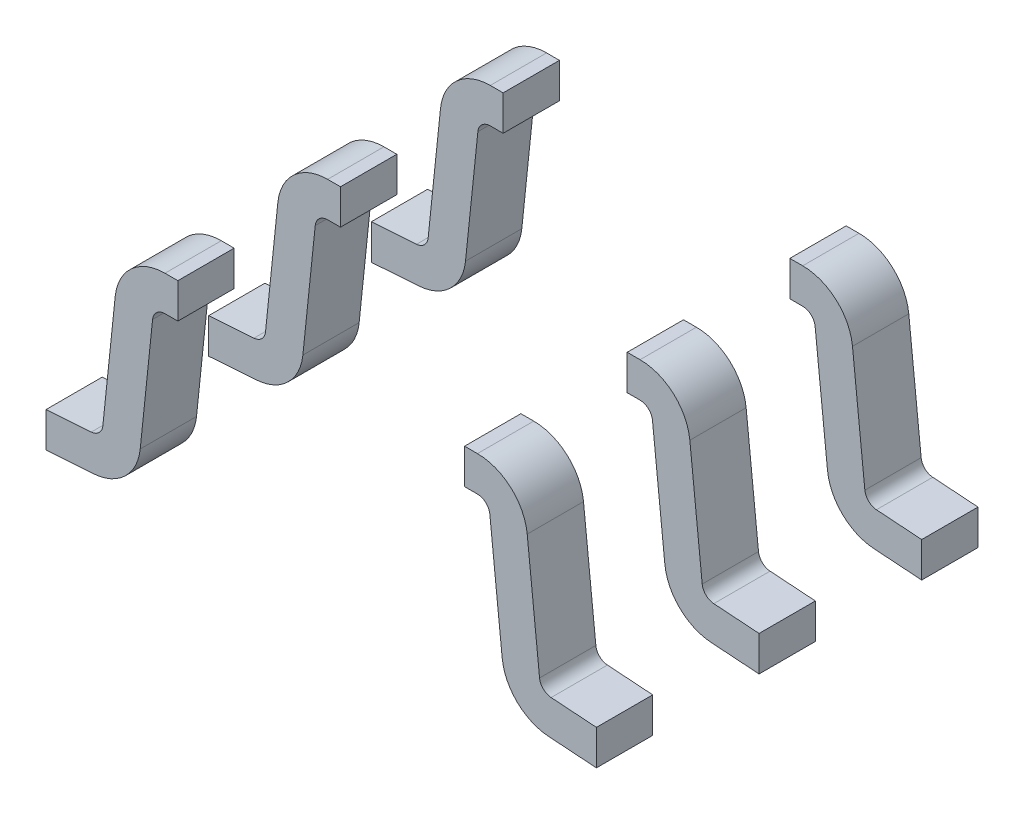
ISO-10303-21;
HEADER;
FILE_DESCRIPTION(('STEP AP214'),'2;1');
FILE_NAME('part.step','',(''),(''),'','','');
FILE_SCHEMA(('AUTOMOTIVE_DESIGN { 1 0 10303 214 1 1 1 1 }'));
ENDSEC;
DATA;
#1=APPLICATION_CONTEXT('core data for automotive mechanical design processes');
#2=APPLICATION_PROTOCOL_DEFINITION('international standard','automotive_design',2000,#1);
#3=PRODUCT_CONTEXT('',#1,'mechanical');
#4=PRODUCT('Part','Part','',(#3));
#5=PRODUCT_RELATED_PRODUCT_CATEGORY('part','',(#4));
#6=PRODUCT_DEFINITION_FORMATION('','',#4);
#7=PRODUCT_DEFINITION_CONTEXT('part definition',#1,'design');
#8=PRODUCT_DEFINITION('design','',#6,#7);
#9=PRODUCT_DEFINITION_SHAPE('','',#8);
#10=(LENGTH_UNIT() NAMED_UNIT(*) SI_UNIT(.MILLI.,.METRE.));
#11=(NAMED_UNIT(*) PLANE_ANGLE_UNIT() SI_UNIT($,.RADIAN.));
#12=(NAMED_UNIT(*) SI_UNIT($,.STERADIAN.) SOLID_ANGLE_UNIT());
#13=UNCERTAINTY_MEASURE_WITH_UNIT(LENGTH_MEASURE(1.E-05),#10,'distance_accuracy_value','');
#14=(GEOMETRIC_REPRESENTATION_CONTEXT(3) GLOBAL_UNCERTAINTY_ASSIGNED_CONTEXT((#13)) GLOBAL_UNIT_ASSIGNED_CONTEXT((#10,
#11,#12)) REPRESENTATION_CONTEXT('',''));
#15=CARTESIAN_POINT('',(0.,0.,0.));
#16=DIRECTION('',(0.,0.,1.));
#17=DIRECTION('',(1.,0.,0.));
#18=AXIS2_PLACEMENT_3D('',#15,#16,#17);
#19=CARTESIAN_POINT('',(0.04987394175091,0.71,-0.65));
#20=DIRECTION('',(0.,-1.,0.));
#21=DIRECTION('',(0.,0.,-1.));
#22=AXIS2_PLACEMENT_3D('',#19,#20,#21);
#23=PLANE('',#22);
#24=DIRECTION('',(0.,0.,-1.));
#25=VECTOR('',#24,1.);
#26=CARTESIAN_POINT('',(0.572900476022,0.71,-0.70625));
#27=LINE('',#26,#25);
#28=CARTESIAN_POINT('',(0.572900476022,0.71,-0.5375));
#29=VERTEX_POINT('',#28);
#30=CARTESIAN_POINT('',(0.572900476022,0.71,-0.7625));
#31=VERTEX_POINT('',#30);
#32=EDGE_CURVE('P0_E209',#29,#31,#27,.T.);
#33=ORIENTED_EDGE('',*,*,#32,.T.);
#34=DIRECTION('',(-1.,0.,0.));
#35=VECTOR('',#34,1.);
#36=CARTESIAN_POINT('',(0.04987394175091,0.71,-0.7625));
#37=LINE('',#36,#35);
#38=CARTESIAN_POINT('',(0.624187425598,0.71,-0.7625));
#39=VERTEX_POINT('',#38);
#40=EDGE_CURVE('P0_E193',#39,#31,#37,.T.);
#41=ORIENTED_EDGE('',*,*,#40,.F.);
#42=DIRECTION('',(0.,0.,-1.));
#43=VECTOR('',#42,1.);
#44=CARTESIAN_POINT('',(0.624187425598,0.71,-0.65));
#45=LINE('',#44,#43);
#46=CARTESIAN_POINT('',(0.624187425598,0.71,-0.5375));
#47=VERTEX_POINT('',#46);
#48=EDGE_CURVE('P0_E247',#47,#39,#45,.T.);
#49=ORIENTED_EDGE('',*,*,#48,.F.);
#50=DIRECTION('',(1.,0.,0.));
#51=VECTOR('',#50,1.);
#52=CARTESIAN_POINT('',(0.04987394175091,0.71,-0.5375));
#53=LINE('',#52,#51);
#54=EDGE_CURVE('P0_E11',#29,#47,#53,.T.);
#55=ORIENTED_EDGE('',*,*,#54,.F.);
#56=EDGE_LOOP('',(#33,#41,#49,#55));
#57=FACE_BOUND('',#56,.T.);
#58=ADVANCED_FACE('P0_F17',(#57),#23,.T.);
#59=CARTESIAN_POINT('',(0.790808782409,0.111309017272,-0.5375));
#60=DIRECTION('',(0.,0.,1.));
#61=DIRECTION('',(1.,0.,0.));
#62=AXIS2_PLACEMENT_3D('',#59,#60,#61);
#63=PLANE('',#62);
#64=DIRECTION('',(0.,1.,0.));
#65=VECTOR('',#64,1.);
#66=CARTESIAN_POINT('',(1.099873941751,0.05565450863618,-0.5375));
#67=LINE('',#66,#65);
#68=CARTESIAN_POINT('',(1.099873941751,0.,-0.5375));
#69=VERTEX_POINT('',#68);
#70=CARTESIAN_POINT('',(1.099873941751,0.140341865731,-0.5375));
#71=VERTEX_POINT('',#70);
#72=EDGE_CURVE('P0_E136',#69,#71,#67,.T.);
#73=ORIENTED_EDGE('',*,*,#72,.T.);
#74=DIRECTION('',(-0.997564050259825,0.0697564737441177,0.));
#75=VECTOR('',#74,1.);
#76=CARTESIAN_POINT('',(1.109639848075,0.139658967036,-0.5375));
#77=LINE('',#76,#75);
#78=CARTESIAN_POINT('',(0.918893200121,0.152997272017,-0.5375));
#79=VERTEX_POINT('',#78);
#80=EDGE_CURVE('P0_E25',#71,#79,#77,.T.);
#81=ORIENTED_EDGE('',*,*,#80,.T.);
#82=CARTESIAN_POINT('',(0.922381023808,0.20287547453,-0.5375));
#83=DIRECTION('',(0.,0.,1.));
#84=DIRECTION('',(-0.694903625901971,-0.71910287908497,0.));
#85=AXIS2_PLACEMENT_3D('',#82,#83,#84);
#86=CIRCLE('',#85,0.05);
#87=CARTESIAN_POINT('',(0.87265137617,0.197682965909,-0.5375));
#88=VERTEX_POINT('',#87);
#89=EDGE_CURVE('P0_E182',#88,#79,#86,.T.);
#90=ORIENTED_EDGE('',*,*,#89,.F.);
#91=DIRECTION('',(-0.103850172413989,0.994592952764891,0.));
#92=VECTOR('',#91,1.);
#93=CARTESIAN_POINT('',(0.87701142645,0.155925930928,-0.5375));
#94=LINE('',#93,#92);
#95=CARTESIAN_POINT('',(0.823254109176,0.670770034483,-0.5375));
#96=VERTEX_POINT('',#95);
#97=EDGE_CURVE('P0_E173',#88,#96,#94,.T.);
#98=ORIENTED_EDGE('',*,*,#97,.T.);
#99=CARTESIAN_POINT('',(0.624335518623,0.65,-0.5375));
#100=DIRECTION('',(0.,0.,-1.));
#101=DIRECTION('',(0.669383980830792,0.742916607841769,0.));
#102=AXIS2_PLACEMENT_3D('',#99,#100,#101);
#103=CIRCLE('',#102,0.2);
#104=CARTESIAN_POINT('',(0.624335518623,0.85,-0.5375));
#105=VERTEX_POINT('',#104);
#106=EDGE_CURVE('P0_E47',#105,#96,#103,.T.);
#107=ORIENTED_EDGE('',*,*,#106,.F.);
#108=DIRECTION('',(-1.,0.,0.));
#109=VECTOR('',#108,1.);
#110=CARTESIAN_POINT('',(0.804539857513,0.85,-0.5375));
#111=LINE('',#110,#109);
#112=CARTESIAN_POINT('',(0.572900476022,0.85,-0.5375));
#113=VERTEX_POINT('',#112);
#114=EDGE_CURVE('P0_E233',#105,#113,#111,.T.);
#115=ORIENTED_EDGE('',*,*,#114,.T.);
#116=DIRECTION('',(0.,-1.,0.));
#117=VECTOR('',#116,1.);
#118=CARTESIAN_POINT('',(0.572900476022,0.485463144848,-0.5375));
#119=LINE('',#118,#117);
#120=EDGE_CURVE('P0_E167',#113,#29,#119,.T.);
#121=ORIENTED_EDGE('',*,*,#120,.T.);
#122=ORIENTED_EDGE('',*,*,#54,.T.);
#123=CARTESIAN_POINT('',(0.624187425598,0.66,-0.5375));
#124=DIRECTION('',(0.,0.,1.));
#125=DIRECTION('',(0.669383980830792,0.742916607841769,0.));
#126=AXIS2_PLACEMENT_3D('',#123,#124,#125);
#127=CIRCLE('',#126,0.05);
#128=CARTESIAN_POINT('',(0.673917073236,0.665192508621,-0.5375));
#129=VERTEX_POINT('',#128);
#130=EDGE_CURVE('P0_E243',#129,#47,#127,.T.);
#131=ORIENTED_EDGE('',*,*,#130,.F.);
#132=DIRECTION('',(0.103850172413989,-0.994592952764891,0.));
#133=VECTOR('',#132,1.);
#134=CARTESIAN_POINT('',(0.66923851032,0.71,-0.5375));
#135=LINE('',#134,#133);
#136=CARTESIAN_POINT('',(0.723310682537,0.192140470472,-0.5375));
#137=VERTEX_POINT('',#136);
#138=EDGE_CURVE('P0_E183',#129,#137,#135,.T.);
#139=ORIENTED_EDGE('',*,*,#138,.T.);
#140=CARTESIAN_POINT('',(0.92222927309,0.212910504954,-0.5375));
#141=DIRECTION('',(0.,0.,-1.));
#142=DIRECTION('',(-0.694903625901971,-0.71910287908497,0.));
#143=AXIS2_PLACEMENT_3D('',#140,#141,#142);
#144=CIRCLE('',#143,0.2);
#145=CARTESIAN_POINT('',(0.908277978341,0.01339769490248,-0.5375));
#146=VERTEX_POINT('',#145);
#147=EDGE_CURVE('P0_E138',#146,#137,#144,.T.);
#148=ORIENTED_EDGE('',*,*,#147,.F.);
#149=DIRECTION('',(0.997564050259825,-0.0697564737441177,0.));
#150=VECTOR('',#149,1.);
#151=CARTESIAN_POINT('',(0.740750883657,0.02511233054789,-0.5375));
#152=LINE('',#151,#150);
#153=EDGE_CURVE('P0_E37',#146,#69,#152,.T.);
#154=ORIENTED_EDGE('',*,*,#153,.T.);
#155=EDGE_LOOP('',(#73,#81,#90,#98,#107,#115,#121,#122,#131,#139,#148,#154));
#156=FACE_BOUND('',#155,.T.);
#157=ADVANCED_FACE('P0_F134',(#156),#63,.T.);
#158=CARTESIAN_POINT('',(0.87701142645,0.155925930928,-0.65));
#159=DIRECTION('',(0.0697564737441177,0.997564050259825,0.));
#160=DIRECTION('',(0.,0.,-1.));
#161=AXIS2_PLACEMENT_3D('',#158,#159,#160);
#162=PLANE('',#161);
#163=DIRECTION('',(0.,0.,-1.));
#164=VECTOR('',#163,1.);
#165=CARTESIAN_POINT('',(1.099873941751,0.140341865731,-0.70625));
#166=LINE('',#165,#164);
#167=CARTESIAN_POINT('',(1.099873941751,0.140341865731,-0.7625));
#168=VERTEX_POINT('',#167);
#169=EDGE_CURVE('P0_E156',#71,#168,#166,.T.);
#170=ORIENTED_EDGE('',*,*,#169,.T.);
#171=DIRECTION('',(0.997564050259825,-0.0697564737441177,0.));
#172=VECTOR('',#171,1.);
#173=CARTESIAN_POINT('',(1.109639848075,0.139658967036,-0.7625));
#174=LINE('',#173,#172);
#175=CARTESIAN_POINT('',(0.918893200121,0.152997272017,-0.7625));
#176=VERTEX_POINT('',#175);
#177=EDGE_CURVE('P0_E230',#176,#168,#174,.T.);
#178=ORIENTED_EDGE('',*,*,#177,.F.);
#179=DIRECTION('',(0.,0.,-1.));
#180=VECTOR('',#179,1.);
#181=CARTESIAN_POINT('',(0.918893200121,0.152997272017,-0.65));
#182=LINE('',#181,#180);
#183=EDGE_CURVE('P0_E196',#79,#176,#182,.T.);
#184=ORIENTED_EDGE('',*,*,#183,.F.);
#185=ORIENTED_EDGE('',*,*,#80,.F.);
#186=EDGE_LOOP('',(#170,#178,#184,#185));
#187=FACE_BOUND('',#186,.T.);
#188=ADVANCED_FACE('P0_F272',(#187),#162,.T.);
#189=CARTESIAN_POINT('',(0.624335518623,0.65,-0.65));
#190=DIRECTION('',(0.,0.,1.));
#191=DIRECTION('',(0.669383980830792,0.74291660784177,0.));
#192=AXIS2_PLACEMENT_3D('',#189,#190,#191);
#193=CYLINDRICAL_SURFACE('',#192,0.2);
#194=ORIENTED_EDGE('',*,*,#106,.T.);
#195=DIRECTION('',(0.,0.,-1.));
#196=VECTOR('',#195,1.);
#197=CARTESIAN_POINT('',(0.823254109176,0.670770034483,-0.65));
#198=LINE('',#197,#196);
#199=CARTESIAN_POINT('',(0.823254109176,0.670770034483,-0.7625));
#200=VERTEX_POINT('',#199);
#201=EDGE_CURVE('P0_E177',#96,#200,#198,.T.);
#202=ORIENTED_EDGE('',*,*,#201,.T.);
#203=CARTESIAN_POINT('',(0.624335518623,0.65,-0.7625));
#204=DIRECTION('',(0.,0.,1.));
#205=DIRECTION('',(0.669383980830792,0.742916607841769,0.));
#206=AXIS2_PLACEMENT_3D('',#203,#204,#205);
#207=CIRCLE('',#206,0.2);
#208=CARTESIAN_POINT('',(0.624335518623,0.85,-0.7625));
#209=VERTEX_POINT('',#208);
#210=EDGE_CURVE('P0_E200',#200,#209,#207,.T.);
#211=ORIENTED_EDGE('',*,*,#210,.T.);
#212=DIRECTION('',(0.,0.,1.));
#213=VECTOR('',#212,1.);
#214=CARTESIAN_POINT('',(0.624335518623,0.85,-0.65));
#215=LINE('',#214,#213);
#216=EDGE_CURVE('P0_E236',#209,#105,#215,.T.);
#217=ORIENTED_EDGE('',*,*,#216,.T.);
#218=EDGE_LOOP('',(#194,#202,#211,#217));
#219=FACE_BOUND('',#218,.T.);
#220=ADVANCED_FACE('P0_F282',(#219),#193,.T.);
#221=CARTESIAN_POINT('',(0.740750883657,0.02511233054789,-0.65));
#222=DIRECTION('',(-0.0697564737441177,-0.997564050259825,0.));
#223=DIRECTION('',(-0.997564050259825,0.0697564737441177,0.));
#224=AXIS2_PLACEMENT_3D('',#221,#222,#223);
#225=PLANE('',#224);
#226=DIRECTION('',(0.,0.,1.));
#227=VECTOR('',#226,1.);
#228=CARTESIAN_POINT('',(0.908277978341,0.01339769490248,-0.65));
#229=LINE('',#228,#227);
#230=CARTESIAN_POINT('',(0.908277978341,0.01339769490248,-0.7625));
#231=VERTEX_POINT('',#230);
#232=EDGE_CURVE('P0_E176',#231,#146,#229,.T.);
#233=ORIENTED_EDGE('',*,*,#232,.F.);
#234=DIRECTION('',(-0.997564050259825,0.0697564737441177,0.));
#235=VECTOR('',#234,1.);
#236=CARTESIAN_POINT('',(0.740750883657,0.02511233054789,-0.7625));
#237=LINE('',#236,#235);
#238=CARTESIAN_POINT('',(1.099873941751,0.,-0.7625));
#239=VERTEX_POINT('',#238);
#240=EDGE_CURVE('P0_E146',#239,#231,#237,.T.);
#241=ORIENTED_EDGE('',*,*,#240,.F.);
#242=DIRECTION('',(0.,0.,-1.));
#243=VECTOR('',#242,1.);
#244=CARTESIAN_POINT('',(1.099873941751,0.,-0.65));
#245=LINE('',#244,#243);
#246=EDGE_CURVE('P0_E143',#69,#239,#245,.T.);
#247=ORIENTED_EDGE('',*,*,#246,.F.);
#248=ORIENTED_EDGE('',*,*,#153,.F.);
#249=EDGE_LOOP('',(#233,#241,#247,#248));
#250=FACE_BOUND('',#249,.T.);
#251=ADVANCED_FACE('P0_F144',(#250),#225,.T.);
#252=CARTESIAN_POINT('',(0.92222927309,0.212910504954,-0.65));
#253=DIRECTION('',(0.,0.,-1.));
#254=DIRECTION('',(-0.694903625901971,-0.71910287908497,0.));
#255=AXIS2_PLACEMENT_3D('',#252,#253,#254);
#256=CYLINDRICAL_SURFACE('',#255,0.2);
#257=CARTESIAN_POINT('',(0.92222927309,0.212910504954,-0.7625));
#258=DIRECTION('',(0.,0.,1.));
#259=DIRECTION('',(-0.694903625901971,-0.71910287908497,0.));
#260=AXIS2_PLACEMENT_3D('',#257,#258,#259);
#261=CIRCLE('',#260,0.2);
#262=CARTESIAN_POINT('',(0.723310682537,0.192140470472,-0.7625));
#263=VERTEX_POINT('',#262);
#264=EDGE_CURVE('P0_E168',#263,#231,#261,.T.);
#265=ORIENTED_EDGE('',*,*,#264,.T.);
#266=ORIENTED_EDGE('',*,*,#232,.T.);
#267=ORIENTED_EDGE('',*,*,#147,.T.);
#268=DIRECTION('',(0.,0.,-1.));
#269=VECTOR('',#268,1.);
#270=CARTESIAN_POINT('',(0.723310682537,0.192140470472,-0.65));
#271=LINE('',#270,#269);
#272=EDGE_CURVE('P0_E250',#137,#263,#271,.T.);
#273=ORIENTED_EDGE('',*,*,#272,.T.);
#274=EDGE_LOOP('',(#265,#266,#267,#273));
#275=FACE_BOUND('',#274,.T.);
#276=ADVANCED_FACE('P0_F304',(#275),#256,.T.);
#277=CARTESIAN_POINT('',(0.87701142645,0.155925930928,-0.65));
#278=DIRECTION('',(0.994592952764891,0.103850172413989,0.));
#279=DIRECTION('',(0.,0.,-1.));
#280=AXIS2_PLACEMENT_3D('',#277,#278,#279);
#281=PLANE('',#280);
#282=DIRECTION('',(0.,0.,1.));
#283=VECTOR('',#282,1.);
#284=CARTESIAN_POINT('',(0.87265137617,0.197682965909,-0.65));
#285=LINE('',#284,#283);
#286=CARTESIAN_POINT('',(0.87265137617,0.197682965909,-0.7625));
#287=VERTEX_POINT('',#286);
#288=EDGE_CURVE('P0_E178',#287,#88,#285,.T.);
#289=ORIENTED_EDGE('',*,*,#288,.F.);
#290=DIRECTION('',(0.103850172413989,-0.994592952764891,0.));
#291=VECTOR('',#290,1.);
#292=CARTESIAN_POINT('',(0.87701142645,0.155925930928,-0.7625));
#293=LINE('',#292,#291);
#294=EDGE_CURVE('P0_E204',#200,#287,#293,.T.);
#295=ORIENTED_EDGE('',*,*,#294,.F.);
#296=ORIENTED_EDGE('',*,*,#201,.F.);
#297=ORIENTED_EDGE('',*,*,#97,.F.);
#298=EDGE_LOOP('',(#289,#295,#296,#297));
#299=FACE_BOUND('',#298,.T.);
#300=ADVANCED_FACE('P0_F278',(#299),#281,.T.);
#301=CARTESIAN_POINT('',(0.922381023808,0.20287547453,-0.65));
#302=DIRECTION('',(0.,0.,1.));
#303=DIRECTION('',(-0.694903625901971,-0.71910287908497,0.));
#304=AXIS2_PLACEMENT_3D('',#301,#302,#303);
#305=CYLINDRICAL_SURFACE('',#304,0.05);
#306=CARTESIAN_POINT('',(0.922381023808,0.20287547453,-0.7625));
#307=DIRECTION('',(0.,0.,-1.));
#308=DIRECTION('',(-0.694903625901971,-0.71910287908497,0.));
#309=AXIS2_PLACEMENT_3D('',#306,#307,#308);
#310=CIRCLE('',#309,0.05);
#311=EDGE_CURVE('P0_E226',#176,#287,#310,.T.);
#312=ORIENTED_EDGE('',*,*,#311,.T.);
#313=ORIENTED_EDGE('',*,*,#288,.T.);
#314=ORIENTED_EDGE('',*,*,#89,.T.);
#315=ORIENTED_EDGE('',*,*,#183,.T.);
#316=EDGE_LOOP('',(#312,#313,#314,#315));
#317=FACE_BOUND('',#316,.T.);
#318=ADVANCED_FACE('P0_F275',(#317),#305,.F.);
#319=CARTESIAN_POINT('',(0.66923851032,0.71,-0.65));
#320=DIRECTION('',(-0.994592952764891,-0.103850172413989,0.));
#321=DIRECTION('',(-0.103850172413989,0.994592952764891,0.));
#322=AXIS2_PLACEMENT_3D('',#319,#320,#321);
#323=PLANE('',#322);
#324=DIRECTION('',(0.,0.,1.));
#325=VECTOR('',#324,1.);
#326=CARTESIAN_POINT('',(0.673917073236,0.665192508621,-0.65));
#327=LINE('',#326,#325);
#328=CARTESIAN_POINT('',(0.673917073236,0.665192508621,-0.7625));
#329=VERTEX_POINT('',#328);
#330=EDGE_CURVE('P0_E239',#329,#129,#327,.T.);
#331=ORIENTED_EDGE('',*,*,#330,.F.);
#332=DIRECTION('',(-0.103850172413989,0.994592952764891,0.));
#333=VECTOR('',#332,1.);
#334=CARTESIAN_POINT('',(0.66923851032,0.71,-0.7625));
#335=LINE('',#334,#333);
#336=EDGE_CURVE('P0_E172',#263,#329,#335,.T.);
#337=ORIENTED_EDGE('',*,*,#336,.F.);
#338=ORIENTED_EDGE('',*,*,#272,.F.);
#339=ORIENTED_EDGE('',*,*,#138,.F.);
#340=EDGE_LOOP('',(#331,#337,#338,#339));
#341=FACE_BOUND('',#340,.T.);
#342=ADVANCED_FACE('P0_F300',(#341),#323,.T.);
#343=CARTESIAN_POINT('',(0.624187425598,0.66,-0.65));
#344=DIRECTION('',(0.,0.,1.));
#345=DIRECTION('',(0.669383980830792,0.74291660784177,0.));
#346=AXIS2_PLACEMENT_3D('',#343,#344,#345);
#347=CYLINDRICAL_SURFACE('',#346,0.05);
#348=CARTESIAN_POINT('',(0.624187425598,0.66,-0.7625));
#349=DIRECTION('',(0.,0.,-1.));
#350=DIRECTION('',(0.669383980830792,0.742916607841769,0.));
#351=AXIS2_PLACEMENT_3D('',#348,#349,#350);
#352=CIRCLE('',#351,0.05);
#353=EDGE_CURVE('P0_E189',#39,#329,#352,.T.);
#354=ORIENTED_EDGE('',*,*,#353,.T.);
#355=ORIENTED_EDGE('',*,*,#330,.T.);
#356=ORIENTED_EDGE('',*,*,#130,.T.);
#357=ORIENTED_EDGE('',*,*,#48,.T.);
#358=EDGE_LOOP('',(#354,#355,#356,#357));
#359=FACE_BOUND('',#358,.T.);
#360=ADVANCED_FACE('P0_F297',(#359),#347,.F.);
#361=CARTESIAN_POINT('',(0.66923851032,0.85,-0.65));
#362=DIRECTION('',(0.,1.,0.));
#363=DIRECTION('',(1.,0.,0.));
#364=AXIS2_PLACEMENT_3D('',#361,#362,#363);
#365=PLANE('',#364);
#366=DIRECTION('',(0.,0.,1.));
#367=VECTOR('',#366,1.);
#368=CARTESIAN_POINT('',(0.572900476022,0.85,-0.70625));
#369=LINE('',#368,#367);
#370=CARTESIAN_POINT('',(0.572900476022,0.85,-0.7625));
#371=VERTEX_POINT('',#370);
#372=EDGE_CURVE('P0_E184',#371,#113,#369,.T.);
#373=ORIENTED_EDGE('',*,*,#372,.T.);
#374=ORIENTED_EDGE('',*,*,#114,.F.);
#375=ORIENTED_EDGE('',*,*,#216,.F.);
#376=DIRECTION('',(1.,0.,0.));
#377=VECTOR('',#376,1.);
#378=CARTESIAN_POINT('',(0.66923851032,0.85,-0.7625));
#379=LINE('',#378,#377);
#380=EDGE_CURVE('P0_E205',#371,#209,#379,.T.);
#381=ORIENTED_EDGE('',*,*,#380,.F.);
#382=EDGE_LOOP('',(#373,#374,#375,#381));
#383=FACE_BOUND('',#382,.T.);
#384=ADVANCED_FACE('P0_F284',(#383),#365,.T.);
#385=CARTESIAN_POINT('',(0.790808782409,0.111309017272,-0.7625));
#386=DIRECTION('',(0.,0.,-1.));
#387=DIRECTION('',(0.,-1.,0.));
#388=AXIS2_PLACEMENT_3D('',#385,#386,#387);
#389=PLANE('',#388);
#390=DIRECTION('',(0.,-1.,0.));
#391=VECTOR('',#390,1.);
#392=CARTESIAN_POINT('',(1.099873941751,0.05565450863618,-0.7625));
#393=LINE('',#392,#391);
#394=EDGE_CURVE('P0_E151',#168,#239,#393,.T.);
#395=ORIENTED_EDGE('',*,*,#394,.T.);
#396=ORIENTED_EDGE('',*,*,#240,.T.);
#397=ORIENTED_EDGE('',*,*,#264,.F.);
#398=ORIENTED_EDGE('',*,*,#336,.T.);
#399=ORIENTED_EDGE('',*,*,#353,.F.);
#400=ORIENTED_EDGE('',*,*,#40,.T.);
#401=DIRECTION('',(0.,1.,0.));
#402=VECTOR('',#401,1.);
#403=CARTESIAN_POINT('',(0.572900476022,0.485463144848,-0.7625));
#404=LINE('',#403,#402);
#405=EDGE_CURVE('P0_E188',#31,#371,#404,.T.);
#406=ORIENTED_EDGE('',*,*,#405,.T.);
#407=ORIENTED_EDGE('',*,*,#380,.T.);
#408=ORIENTED_EDGE('',*,*,#210,.F.);
#409=ORIENTED_EDGE('',*,*,#294,.T.);
#410=ORIENTED_EDGE('',*,*,#311,.F.);
#411=ORIENTED_EDGE('',*,*,#177,.T.);
#412=EDGE_LOOP('',(#395,#396,#397,#398,#399,#400,#406,#407,#408,#409,#410,#411));
#413=FACE_BOUND('',#412,.T.);
#414=ADVANCED_FACE('P0_F306',(#413),#389,.T.);
#415=CARTESIAN_POINT('',(0.572900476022,0.859617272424,-0.7625));
#416=DIRECTION('',(1.,0.,0.));
#417=DIRECTION('',(0.,1.,0.));
#418=AXIS2_PLACEMENT_3D('',#415,#416,#417);
#419=PLANE('',#418);
#420=ORIENTED_EDGE('',*,*,#120,.F.);
#421=ORIENTED_EDGE('',*,*,#372,.F.);
#422=ORIENTED_EDGE('',*,*,#405,.F.);
#423=ORIENTED_EDGE('',*,*,#32,.F.);
#424=EDGE_LOOP('',(#420,#421,#422,#423));
#425=FACE_BOUND('',#424,.T.);
#426=ADVANCED_FACE('P0_F290',(#425),#419,.F.);
#427=CARTESIAN_POINT('',(1.099873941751,0.,-0.7625));
#428=DIRECTION('',(-1.,0.,0.));
#429=DIRECTION('',(0.,0.,1.));
#430=AXIS2_PLACEMENT_3D('',#427,#428,#429);
#431=PLANE('',#430);
#432=ORIENTED_EDGE('',*,*,#72,.F.);
#433=ORIENTED_EDGE('',*,*,#246,.T.);
#434=ORIENTED_EDGE('',*,*,#394,.F.);
#435=ORIENTED_EDGE('',*,*,#169,.F.);
#436=EDGE_LOOP('',(#432,#433,#434,#435));
#437=FACE_BOUND('',#436,.T.);
#438=ADVANCED_FACE('P0_F154',(#437),#431,.F.);
#439=CLOSED_SHELL('',(#58,#157,#188,#220,#251,#276,#300,#318,#342,#360,#384,#414,#426,#438));
#440=MANIFOLD_SOLID_BREP('P0_B1',#439);
#441=CARTESIAN_POINT('',(-1.099873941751,0.195743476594,-0.7625));
#442=DIRECTION('',(1.,0.,0.));
#443=DIRECTION('',(0.,1.,0.));
#444=AXIS2_PLACEMENT_3D('',#441,#442,#443);
#445=PLANE('',#444);
#446=DIRECTION('',(0.,1.,0.));
#447=VECTOR('',#446,1.);
#448=CARTESIAN_POINT('',(-1.099873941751,0.153526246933,-0.7625));
#449=LINE('',#448,#447);
#450=CARTESIAN_POINT('',(-1.099873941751,0.,-0.7625));
#451=VERTEX_POINT('',#450);
#452=CARTESIAN_POINT('',(-1.099873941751,0.140341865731,-0.7625));
#453=VERTEX_POINT('',#452);
#454=EDGE_CURVE('P1_E284',#451,#453,#449,.T.);
#455=ORIENTED_EDGE('',*,*,#454,.F.);
#456=DIRECTION('',(0.,0.,-1.));
#457=VECTOR('',#456,1.);
#458=CARTESIAN_POINT('',(-1.099873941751,0.,-0.65));
#459=LINE('',#458,#457);
#460=CARTESIAN_POINT('',(-1.099873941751,0.,-0.5375));
#461=VERTEX_POINT('',#460);
#462=EDGE_CURVE('P1_E146',#461,#451,#459,.T.);
#463=ORIENTED_EDGE('',*,*,#462,.F.);
#464=DIRECTION('',(0.,-1.,0.));
#465=VECTOR('',#464,1.);
#466=CARTESIAN_POINT('',(-1.099873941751,0.153526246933,-0.5375));
#467=LINE('',#466,#465);
#468=CARTESIAN_POINT('',(-1.099873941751,0.140341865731,-0.5375));
#469=VERTEX_POINT('',#468);
#470=EDGE_CURVE('P1_E206',#469,#461,#467,.T.);
#471=ORIENTED_EDGE('',*,*,#470,.F.);
#472=DIRECTION('',(0.,0.,1.));
#473=VECTOR('',#472,1.);
#474=CARTESIAN_POINT('',(-1.099873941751,0.140341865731,-0.70625));
#475=LINE('',#474,#473);
#476=EDGE_CURVE('P1_E321',#453,#469,#475,.T.);
#477=ORIENTED_EDGE('',*,*,#476,.F.);
#478=EDGE_LOOP('',(#455,#463,#471,#477));
#479=FACE_BOUND('',#478,.T.);
#480=ADVANCED_FACE('P1_F17',(#479),#445,.F.);
#481=CARTESIAN_POINT('',(-0.572900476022,-0.859617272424,-0.7625));
#482=DIRECTION('',(-1.,0.,0.));
#483=DIRECTION('',(0.,1.,0.));
#484=AXIS2_PLACEMENT_3D('',#481,#482,#483);
#485=PLANE('',#484);
#486=DIRECTION('',(0.,1.,0.));
#487=VECTOR('',#486,1.);
#488=CARTESIAN_POINT('',(-0.572900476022,-0.374154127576,-0.5375));
#489=LINE('',#488,#487);
#490=CARTESIAN_POINT('',(-0.572900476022,0.71,-0.5375));
#491=VERTEX_POINT('',#490);
#492=CARTESIAN_POINT('',(-0.572900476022,0.85,-0.5375));
#493=VERTEX_POINT('',#492);
#494=EDGE_CURVE('P1_E25',#491,#493,#489,.T.);
#495=ORIENTED_EDGE('',*,*,#494,.F.);
#496=DIRECTION('',(0.,0.,1.));
#497=VECTOR('',#496,1.);
#498=CARTESIAN_POINT('',(-0.572900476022,0.71,-0.70625));
#499=LINE('',#498,#497);
#500=CARTESIAN_POINT('',(-0.572900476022,0.71,-0.7625));
#501=VERTEX_POINT('',#500);
#502=EDGE_CURVE('P1_E11',#501,#491,#499,.T.);
#503=ORIENTED_EDGE('',*,*,#502,.F.);
#504=DIRECTION('',(0.,-1.,0.));
#505=VECTOR('',#504,1.);
#506=CARTESIAN_POINT('',(-0.572900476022,-0.374154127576,-0.7625));
#507=LINE('',#506,#505);
#508=CARTESIAN_POINT('',(-0.572900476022,0.85,-0.7625));
#509=VERTEX_POINT('',#508);
#510=EDGE_CURVE('P1_E275',#509,#501,#507,.T.);
#511=ORIENTED_EDGE('',*,*,#510,.F.);
#512=DIRECTION('',(0.,0.,-1.));
#513=VECTOR('',#512,1.);
#514=CARTESIAN_POINT('',(-0.572900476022,0.85,-0.70625));
#515=LINE('',#514,#513);
#516=EDGE_CURVE('P1_E356',#493,#509,#515,.T.);
#517=ORIENTED_EDGE('',*,*,#516,.F.);
#518=EDGE_LOOP('',(#495,#503,#511,#517));
#519=FACE_BOUND('',#518,.T.);
#520=ADVANCED_FACE('P1_F375',(#519),#485,.F.);
#521=CARTESIAN_POINT('',(-0.04987394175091,0.71,-0.65));
#522=DIRECTION('',(0.,1.,0.));
#523=DIRECTION('',(1.,0.,0.));
#524=AXIS2_PLACEMENT_3D('',#521,#522,#523);
#525=PLANE('',#524);
#526=ORIENTED_EDGE('',*,*,#502,.T.);
#527=DIRECTION('',(-1.,0.,0.));
#528=VECTOR('',#527,1.);
#529=CARTESIAN_POINT('',(-0.04987394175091,0.71,-0.5375));
#530=LINE('',#529,#528);
#531=CARTESIAN_POINT('',(-0.624187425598,0.71,-0.5375));
#532=VERTEX_POINT('',#531);
#533=EDGE_CURVE('P1_E42',#491,#532,#530,.T.);
#534=ORIENTED_EDGE('',*,*,#533,.T.);
#535=DIRECTION('',(0.,0.,-1.));
#536=VECTOR('',#535,1.);
#537=CARTESIAN_POINT('',(-0.624187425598,0.71,-0.65));
#538=LINE('',#537,#536);
#539=CARTESIAN_POINT('',(-0.624187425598,0.71,-0.7625));
#540=VERTEX_POINT('',#539);
#541=EDGE_CURVE('P1_E200',#532,#540,#538,.T.);
#542=ORIENTED_EDGE('',*,*,#541,.T.);
#543=DIRECTION('',(1.,0.,0.));
#544=VECTOR('',#543,1.);
#545=CARTESIAN_POINT('',(-0.04987394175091,0.71,-0.7625));
#546=LINE('',#545,#544);
#547=EDGE_CURVE('P1_E169',#540,#501,#546,.T.);
#548=ORIENTED_EDGE('',*,*,#547,.T.);
#549=EDGE_LOOP('',(#526,#534,#542,#548));
#550=FACE_BOUND('',#549,.T.);
#551=ADVANCED_FACE('P1_F376',(#550),#525,.F.);
#552=CARTESIAN_POINT('',(-0.790808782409,0.111309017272,-0.5375));
#553=DIRECTION('',(0.,0.,-1.));
#554=DIRECTION('',(0.,-1.,0.));
#555=AXIS2_PLACEMENT_3D('',#552,#553,#554);
#556=PLANE('',#555);
#557=ORIENTED_EDGE('',*,*,#470,.T.);
#558=DIRECTION('',(-0.997564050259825,-0.0697564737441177,0.));
#559=VECTOR('',#558,1.);
#560=CARTESIAN_POINT('',(-0.740750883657,0.02511233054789,-0.5375));
#561=LINE('',#560,#559);
#562=CARTESIAN_POINT('',(-0.908277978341,0.01339769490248,-0.5375));
#563=VERTEX_POINT('',#562);
#564=EDGE_CURVE('P1_E177',#563,#461,#561,.T.);
#565=ORIENTED_EDGE('',*,*,#564,.F.);
#566=CARTESIAN_POINT('',(-0.92222927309,0.212910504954,-0.5375));
#567=DIRECTION('',(0.,0.,1.));
#568=DIRECTION('',(0.694903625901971,-0.71910287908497,0.));
#569=AXIS2_PLACEMENT_3D('',#566,#567,#568);
#570=CIRCLE('',#569,0.2);
#571=CARTESIAN_POINT('',(-0.723310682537,0.192140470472,-0.5375));
#572=VERTEX_POINT('',#571);
#573=EDGE_CURVE('P1_E145',#563,#572,#570,.T.);
#574=ORIENTED_EDGE('',*,*,#573,.T.);
#575=DIRECTION('',(-0.103850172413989,-0.994592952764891,0.));
#576=VECTOR('',#575,1.);
#577=CARTESIAN_POINT('',(-0.66923851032,0.71,-0.5375));
#578=LINE('',#577,#576);
#579=CARTESIAN_POINT('',(-0.673917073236,0.665192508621,-0.5375));
#580=VERTEX_POINT('',#579);
#581=EDGE_CURVE('P1_E141',#580,#572,#578,.T.);
#582=ORIENTED_EDGE('',*,*,#581,.F.);
#583=CARTESIAN_POINT('',(-0.624187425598,0.66,-0.5375));
#584=DIRECTION('',(0.,0.,-1.));
#585=DIRECTION('',(-0.669383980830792,0.742916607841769,0.));
#586=AXIS2_PLACEMENT_3D('',#583,#584,#585);
#587=CIRCLE('',#586,0.05);
#588=EDGE_CURVE('P1_E203',#580,#532,#587,.T.);
#589=ORIENTED_EDGE('',*,*,#588,.T.);
#590=ORIENTED_EDGE('',*,*,#533,.F.);
#591=ORIENTED_EDGE('',*,*,#494,.T.);
#592=DIRECTION('',(1.,0.,0.));
#593=VECTOR('',#592,1.);
#594=CARTESIAN_POINT('',(-0.804539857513,0.85,-0.5375));
#595=LINE('',#594,#593);
#596=CARTESIAN_POINT('',(-0.624335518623,0.85,-0.5375));
#597=VERTEX_POINT('',#596);
#598=EDGE_CURVE('P1_E332',#597,#493,#595,.T.);
#599=ORIENTED_EDGE('',*,*,#598,.F.);
#600=CARTESIAN_POINT('',(-0.624335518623,0.65,-0.5375));
#601=DIRECTION('',(0.,0.,1.));
#602=DIRECTION('',(-0.669383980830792,0.742916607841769,0.));
#603=AXIS2_PLACEMENT_3D('',#600,#601,#602);
#604=CIRCLE('',#603,0.2);
#605=CARTESIAN_POINT('',(-0.823254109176,0.670770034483,-0.5375));
#606=VERTEX_POINT('',#605);
#607=EDGE_CURVE('P1_E304',#597,#606,#604,.T.);
#608=ORIENTED_EDGE('',*,*,#607,.T.);
#609=DIRECTION('',(0.103850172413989,0.994592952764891,0.));
#610=VECTOR('',#609,1.);
#611=CARTESIAN_POINT('',(-0.87701142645,0.155925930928,-0.5375));
#612=LINE('',#611,#610);
#613=CARTESIAN_POINT('',(-0.87265137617,0.197682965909,-0.5375));
#614=VERTEX_POINT('',#613);
#615=EDGE_CURVE('P1_E189',#614,#606,#612,.T.);
#616=ORIENTED_EDGE('',*,*,#615,.F.);
#617=CARTESIAN_POINT('',(-0.922381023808,0.20287547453,-0.5375));
#618=DIRECTION('',(0.,0.,-1.));
#619=DIRECTION('',(0.694903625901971,-0.71910287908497,0.));
#620=AXIS2_PLACEMENT_3D('',#617,#618,#619);
#621=CIRCLE('',#620,0.05);
#622=CARTESIAN_POINT('',(-0.918893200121,0.152997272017,-0.5375));
#623=VERTEX_POINT('',#622);
#624=EDGE_CURVE('P1_E192',#614,#623,#621,.T.);
#625=ORIENTED_EDGE('',*,*,#624,.T.);
#626=DIRECTION('',(0.997564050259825,0.0697564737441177,0.));
#627=VECTOR('',#626,1.);
#628=CARTESIAN_POINT('',(-1.109639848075,0.139658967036,-0.5375));
#629=LINE('',#628,#627);
#630=EDGE_CURVE('P1_E315',#469,#623,#629,.T.);
#631=ORIENTED_EDGE('',*,*,#630,.F.);
#632=EDGE_LOOP('',(#557,#565,#574,#582,#589,#590,#591,#599,#608,#616,#625,#631));
#633=FACE_BOUND('',#632,.T.);
#634=ADVANCED_FACE('P1_F381',(#633),#556,.F.);
#635=CARTESIAN_POINT('',(-0.624187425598,0.66,-0.65));
#636=DIRECTION('',(0.,0.,-1.));
#637=DIRECTION('',(-0.669383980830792,0.74291660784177,0.));
#638=AXIS2_PLACEMENT_3D('',#635,#636,#637);
#639=CYLINDRICAL_SURFACE('',#638,0.05);
#640=CARTESIAN_POINT('',(-0.624187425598,0.66,-0.7625));
#641=DIRECTION('',(0.,0.,1.));
#642=DIRECTION('',(-0.669383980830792,0.742916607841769,0.));
#643=AXIS2_PLACEMENT_3D('',#640,#641,#642);
#644=CIRCLE('',#643,0.05);
#645=CARTESIAN_POINT('',(-0.673917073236,0.665192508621,-0.7625));
#646=VERTEX_POINT('',#645);
#647=EDGE_CURVE('P1_E162',#540,#646,#644,.T.);
#648=ORIENTED_EDGE('',*,*,#647,.F.);
#649=ORIENTED_EDGE('',*,*,#541,.F.);
#650=ORIENTED_EDGE('',*,*,#588,.F.);
#651=DIRECTION('',(0.,0.,1.));
#652=VECTOR('',#651,1.);
#653=CARTESIAN_POINT('',(-0.673917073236,0.665192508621,-0.65));
#654=LINE('',#653,#652);
#655=EDGE_CURVE('P1_E195',#646,#580,#654,.T.);
#656=ORIENTED_EDGE('',*,*,#655,.F.);
#657=EDGE_LOOP('',(#648,#649,#650,#656));
#658=FACE_BOUND('',#657,.T.);
#659=ADVANCED_FACE('P1_F379',(#658),#639,.F.);
#660=CARTESIAN_POINT('',(-0.66923851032,0.71,-0.65));
#661=DIRECTION('',(-0.994592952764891,0.103850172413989,0.));
#662=DIRECTION('',(0.,0.,1.));
#663=AXIS2_PLACEMENT_3D('',#660,#661,#662);
#664=PLANE('',#663);
#665=ORIENTED_EDGE('',*,*,#655,.T.);
#666=ORIENTED_EDGE('',*,*,#581,.T.);
#667=DIRECTION('',(0.,0.,-1.));
#668=VECTOR('',#667,1.);
#669=CARTESIAN_POINT('',(-0.723310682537,0.192140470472,-0.65));
#670=LINE('',#669,#668);
#671=CARTESIAN_POINT('',(-0.723310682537,0.192140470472,-0.7625));
#672=VERTEX_POINT('',#671);
#673=EDGE_CURVE('P1_E133',#572,#672,#670,.T.);
#674=ORIENTED_EDGE('',*,*,#673,.T.);
#675=DIRECTION('',(0.103850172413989,0.994592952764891,0.));
#676=VECTOR('',#675,1.);
#677=CARTESIAN_POINT('',(-0.66923851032,0.71,-0.7625));
#678=LINE('',#677,#676);
#679=EDGE_CURVE('P1_E138',#672,#646,#678,.T.);
#680=ORIENTED_EDGE('',*,*,#679,.T.);
#681=EDGE_LOOP('',(#665,#666,#674,#680));
#682=FACE_BOUND('',#681,.T.);
#683=ADVANCED_FACE('P1_F136',(#682),#664,.F.);
#684=CARTESIAN_POINT('',(-0.922381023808,0.20287547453,-0.65));
#685=DIRECTION('',(0.,0.,-1.));
#686=DIRECTION('',(0.694903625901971,-0.71910287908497,0.));
#687=AXIS2_PLACEMENT_3D('',#684,#685,#686);
#688=CYLINDRICAL_SURFACE('',#687,0.05);
#689=CARTESIAN_POINT('',(-0.922381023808,0.20287547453,-0.7625));
#690=DIRECTION('',(0.,0.,1.));
#691=DIRECTION('',(0.694903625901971,-0.71910287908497,0.));
#692=AXIS2_PLACEMENT_3D('',#689,#690,#691);
#693=CIRCLE('',#692,0.05);
#694=CARTESIAN_POINT('',(-0.918893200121,0.152997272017,-0.7625));
#695=VERTEX_POINT('',#694);
#696=CARTESIAN_POINT('',(-0.87265137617,0.197682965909,-0.7625));
#697=VERTEX_POINT('',#696);
#698=EDGE_CURVE('P1_E278',#695,#697,#693,.T.);
#699=ORIENTED_EDGE('',*,*,#698,.F.);
#700=DIRECTION('',(0.,0.,-1.));
#701=VECTOR('',#700,1.);
#702=CARTESIAN_POINT('',(-0.918893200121,0.152997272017,-0.65));
#703=LINE('',#702,#701);
#704=EDGE_CURVE('P1_E320',#623,#695,#703,.T.);
#705=ORIENTED_EDGE('',*,*,#704,.F.);
#706=ORIENTED_EDGE('',*,*,#624,.F.);
#707=DIRECTION('',(0.,0.,1.));
#708=VECTOR('',#707,1.);
#709=CARTESIAN_POINT('',(-0.87265137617,0.197682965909,-0.65));
#710=LINE('',#709,#708);
#711=EDGE_CURVE('P1_E185',#697,#614,#710,.T.);
#712=ORIENTED_EDGE('',*,*,#711,.F.);
#713=EDGE_LOOP('',(#699,#705,#706,#712));
#714=FACE_BOUND('',#713,.T.);
#715=ADVANCED_FACE('P1_F395',(#714),#688,.F.);
#716=CARTESIAN_POINT('',(-0.87701142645,0.155925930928,-0.65));
#717=DIRECTION('',(0.994592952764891,-0.103850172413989,0.));
#718=DIRECTION('',(0.,0.,-1.));
#719=AXIS2_PLACEMENT_3D('',#716,#717,#718);
#720=PLANE('',#719);
#721=ORIENTED_EDGE('',*,*,#711,.T.);
#722=ORIENTED_EDGE('',*,*,#615,.T.);
#723=DIRECTION('',(0.,0.,-1.));
#724=VECTOR('',#723,1.);
#725=CARTESIAN_POINT('',(-0.823254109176,0.670770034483,-0.65));
#726=LINE('',#725,#724);
#727=CARTESIAN_POINT('',(-0.823254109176,0.670770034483,-0.7625));
#728=VERTEX_POINT('',#727);
#729=EDGE_CURVE('P1_E291',#606,#728,#726,.T.);
#730=ORIENTED_EDGE('',*,*,#729,.T.);
#731=DIRECTION('',(-0.103850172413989,-0.994592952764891,0.));
#732=VECTOR('',#731,1.);
#733=CARTESIAN_POINT('',(-0.87701142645,0.155925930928,-0.7625));
#734=LINE('',#733,#732);
#735=EDGE_CURVE('P1_E283',#728,#697,#734,.T.);
#736=ORIENTED_EDGE('',*,*,#735,.T.);
#737=EDGE_LOOP('',(#721,#722,#730,#736));
#738=FACE_BOUND('',#737,.T.);
#739=ADVANCED_FACE('P1_F398',(#738),#720,.F.);
#740=CARTESIAN_POINT('',(-0.92222927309,0.212910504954,-0.65));
#741=DIRECTION('',(0.,0.,1.));
#742=DIRECTION('',(0.694903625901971,-0.71910287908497,0.));
#743=AXIS2_PLACEMENT_3D('',#740,#741,#742);
#744=CYLINDRICAL_SURFACE('',#743,0.2);
#745=CARTESIAN_POINT('',(-0.92222927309,0.212910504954,-0.7625));
#746=DIRECTION('',(0.,0.,-1.));
#747=DIRECTION('',(0.694903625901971,-0.71910287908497,0.));
#748=AXIS2_PLACEMENT_3D('',#745,#746,#747);
#749=CIRCLE('',#748,0.2);
#750=CARTESIAN_POINT('',(-0.908277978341,0.01339769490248,-0.7625));
#751=VERTEX_POINT('',#750);
#752=EDGE_CURVE('P1_E149',#672,#751,#749,.T.);
#753=ORIENTED_EDGE('',*,*,#752,.F.);
#754=ORIENTED_EDGE('',*,*,#673,.F.);
#755=ORIENTED_EDGE('',*,*,#573,.F.);
#756=DIRECTION('',(0.,0.,1.));
#757=VECTOR('',#756,1.);
#758=CARTESIAN_POINT('',(-0.908277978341,0.01339769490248,-0.65));
#759=LINE('',#758,#757);
#760=EDGE_CURVE('P1_E152',#751,#563,#759,.T.);
#761=ORIENTED_EDGE('',*,*,#760,.F.);
#762=EDGE_LOOP('',(#753,#754,#755,#761));
#763=FACE_BOUND('',#762,.T.);
#764=ADVANCED_FACE('P1_F150',(#763),#744,.T.);
#765=CARTESIAN_POINT('',(-0.740750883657,0.02511233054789,-0.65));
#766=DIRECTION('',(-0.0697564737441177,0.997564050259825,0.));
#767=DIRECTION('',(0.,0.,1.));
#768=AXIS2_PLACEMENT_3D('',#765,#766,#767);
#769=PLANE('',#768);
#770=ORIENTED_EDGE('',*,*,#760,.T.);
#771=ORIENTED_EDGE('',*,*,#564,.T.);
#772=ORIENTED_EDGE('',*,*,#462,.T.);
#773=DIRECTION('',(0.997564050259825,0.0697564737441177,0.));
#774=VECTOR('',#773,1.);
#775=CARTESIAN_POINT('',(-0.740750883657,0.02511233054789,-0.7625));
#776=LINE('',#775,#774);
#777=EDGE_CURVE('P1_E157',#451,#751,#776,.T.);
#778=ORIENTED_EDGE('',*,*,#777,.T.);
#779=EDGE_LOOP('',(#770,#771,#772,#778));
#780=FACE_BOUND('',#779,.T.);
#781=ADVANCED_FACE('P1_F386',(#780),#769,.F.);
#782=CARTESIAN_POINT('',(-0.790808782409,0.111309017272,-0.7625));
#783=DIRECTION('',(0.,0.,1.));
#784=DIRECTION('',(1.,0.,0.));
#785=AXIS2_PLACEMENT_3D('',#782,#783,#784);
#786=PLANE('',#785);
#787=ORIENTED_EDGE('',*,*,#454,.T.);
#788=DIRECTION('',(-0.997564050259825,-0.0697564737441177,0.));
#789=VECTOR('',#788,1.);
#790=CARTESIAN_POINT('',(-1.109639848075,0.139658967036,-0.7625));
#791=LINE('',#790,#789);
#792=EDGE_CURVE('P1_E311',#695,#453,#791,.T.);
#793=ORIENTED_EDGE('',*,*,#792,.F.);
#794=ORIENTED_EDGE('',*,*,#698,.T.);
#795=ORIENTED_EDGE('',*,*,#735,.F.);
#796=CARTESIAN_POINT('',(-0.624335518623,0.65,-0.7625));
#797=DIRECTION('',(0.,0.,-1.));
#798=DIRECTION('',(-0.669383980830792,0.742916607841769,0.));
#799=AXIS2_PLACEMENT_3D('',#796,#797,#798);
#800=CIRCLE('',#799,0.2);
#801=CARTESIAN_POINT('',(-0.624335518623,0.85,-0.7625));
#802=VERTEX_POINT('',#801);
#803=EDGE_CURVE('P1_E298',#728,#802,#800,.T.);
#804=ORIENTED_EDGE('',*,*,#803,.T.);
#805=DIRECTION('',(-1.,0.,0.));
#806=VECTOR('',#805,1.);
#807=CARTESIAN_POINT('',(-0.66923851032,0.85,-0.7625));
#808=LINE('',#807,#806);
#809=EDGE_CURVE('P1_E348',#509,#802,#808,.T.);
#810=ORIENTED_EDGE('',*,*,#809,.F.);
#811=ORIENTED_EDGE('',*,*,#510,.T.);
#812=ORIENTED_EDGE('',*,*,#547,.F.);
#813=ORIENTED_EDGE('',*,*,#647,.T.);
#814=ORIENTED_EDGE('',*,*,#679,.F.);
#815=ORIENTED_EDGE('',*,*,#752,.T.);
#816=ORIENTED_EDGE('',*,*,#777,.F.);
#817=EDGE_LOOP('',(#787,#793,#794,#795,#804,#810,#811,#812,#813,#814,#815,#816));
#818=FACE_BOUND('',#817,.T.);
#819=ADVANCED_FACE('P1_F159',(#818),#786,.F.);
#820=CARTESIAN_POINT('',(-0.624335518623,0.65,-0.65));
#821=DIRECTION('',(0.,0.,-1.));
#822=DIRECTION('',(-0.669383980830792,0.74291660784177,0.));
#823=AXIS2_PLACEMENT_3D('',#820,#821,#822);
#824=CYLINDRICAL_SURFACE('',#823,0.2);
#825=ORIENTED_EDGE('',*,*,#607,.F.);
#826=DIRECTION('',(0.,0.,1.));
#827=VECTOR('',#826,1.);
#828=CARTESIAN_POINT('',(-0.624335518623,0.85,-0.65));
#829=LINE('',#828,#827);
#830=EDGE_CURVE('P1_E340',#802,#597,#829,.T.);
#831=ORIENTED_EDGE('',*,*,#830,.F.);
#832=ORIENTED_EDGE('',*,*,#803,.F.);
#833=ORIENTED_EDGE('',*,*,#729,.F.);
#834=EDGE_LOOP('',(#825,#831,#832,#833));
#835=FACE_BOUND('',#834,.T.);
#836=ADVANCED_FACE('P1_F403',(#835),#824,.T.);
#837=CARTESIAN_POINT('',(-0.87701142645,0.155925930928,-0.65));
#838=DIRECTION('',(0.0697564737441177,-0.997564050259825,0.));
#839=DIRECTION('',(0.,0.,-1.));
#840=AXIS2_PLACEMENT_3D('',#837,#838,#839);
#841=PLANE('',#840);
#842=ORIENTED_EDGE('',*,*,#476,.T.);
#843=ORIENTED_EDGE('',*,*,#630,.T.);
#844=ORIENTED_EDGE('',*,*,#704,.T.);
#845=ORIENTED_EDGE('',*,*,#792,.T.);
#846=EDGE_LOOP('',(#842,#843,#844,#845));
#847=FACE_BOUND('',#846,.T.);
#848=ADVANCED_FACE('P1_F392',(#847),#841,.F.);
#849=CARTESIAN_POINT('',(-0.66923851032,0.85,-0.65));
#850=DIRECTION('',(0.,-1.,0.));
#851=DIRECTION('',(-1.,0.,0.));
#852=AXIS2_PLACEMENT_3D('',#849,#850,#851);
#853=PLANE('',#852);
#854=ORIENTED_EDGE('',*,*,#516,.T.);
#855=ORIENTED_EDGE('',*,*,#809,.T.);
#856=ORIENTED_EDGE('',*,*,#830,.T.);
#857=ORIENTED_EDGE('',*,*,#598,.T.);
#858=EDGE_LOOP('',(#854,#855,#856,#857));
#859=FACE_BOUND('',#858,.T.);
#860=ADVANCED_FACE('P1_F405',(#859),#853,.F.);
#861=CLOSED_SHELL('',(#480,#520,#551,#634,#659,#683,#715,#739,#764,#781,#819,#836,#848,#860));
#862=MANIFOLD_SOLID_BREP('P1_B1',#861);
#863=CARTESIAN_POINT('',(0.04987394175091,0.71,0.));
#864=DIRECTION('',(0.,-1.,0.));
#865=DIRECTION('',(0.,0.,-1.));
#866=AXIS2_PLACEMENT_3D('',#863,#864,#865);
#867=PLANE('',#866);
#868=DIRECTION('',(0.,0.,-1.));
#869=VECTOR('',#868,1.);
#870=CARTESIAN_POINT('',(0.572900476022,0.71,-0.38125));
#871=LINE('',#870,#869);
#872=CARTESIAN_POINT('',(0.572900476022,0.71,0.1125));
#873=VERTEX_POINT('',#872);
#874=CARTESIAN_POINT('',(0.572900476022,0.71,-0.1125));
#875=VERTEX_POINT('',#874);
#876=EDGE_CURVE('P2_E166',#873,#875,#871,.T.);
#877=ORIENTED_EDGE('',*,*,#876,.T.);
#878=DIRECTION('',(-1.,0.,0.));
#879=VECTOR('',#878,1.);
#880=CARTESIAN_POINT('',(0.04987394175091,0.71,-0.1125));
#881=LINE('',#880,#879);
#882=CARTESIAN_POINT('',(0.624187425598,0.71,-0.1125));
#883=VERTEX_POINT('',#882);
#884=EDGE_CURVE('P2_E207',#883,#875,#881,.T.);
#885=ORIENTED_EDGE('',*,*,#884,.F.);
#886=DIRECTION('',(0.,0.,-1.));
#887=VECTOR('',#886,1.);
#888=CARTESIAN_POINT('',(0.624187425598,0.71,0.));
#889=LINE('',#888,#887);
#890=CARTESIAN_POINT('',(0.624187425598,0.71,0.1125));
#891=VERTEX_POINT('',#890);
#892=EDGE_CURVE('P2_E250',#891,#883,#889,.T.);
#893=ORIENTED_EDGE('',*,*,#892,.F.);
#894=DIRECTION('',(1.,0.,0.));
#895=VECTOR('',#894,1.);
#896=CARTESIAN_POINT('',(0.04987394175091,0.71,0.1125));
#897=LINE('',#896,#895);
#898=EDGE_CURVE('P2_E11',#873,#891,#897,.T.);
#899=ORIENTED_EDGE('',*,*,#898,.F.);
#900=EDGE_LOOP('',(#877,#885,#893,#899));
#901=FACE_BOUND('',#900,.T.);
#902=ADVANCED_FACE('P2_F17',(#901),#867,.T.);
#903=CARTESIAN_POINT('',(0.790808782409,0.111309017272,0.1125));
#904=DIRECTION('',(0.,0.,1.));
#905=DIRECTION('',(1.,0.,0.));
#906=AXIS2_PLACEMENT_3D('',#903,#904,#905);
#907=PLANE('',#906);
#908=DIRECTION('',(0.,1.,0.));
#909=VECTOR('',#908,1.);
#910=CARTESIAN_POINT('',(1.099873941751,0.05565450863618,0.1125));
#911=LINE('',#910,#909);
#912=CARTESIAN_POINT('',(1.099873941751,0.,0.1125));
#913=VERTEX_POINT('',#912);
#914=CARTESIAN_POINT('',(1.099873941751,0.140341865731,0.1125));
#915=VERTEX_POINT('',#914);
#916=EDGE_CURVE('P2_E136',#913,#915,#911,.T.);
#917=ORIENTED_EDGE('',*,*,#916,.T.);
#918=DIRECTION('',(-0.997564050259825,0.0697564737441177,0.));
#919=VECTOR('',#918,1.);
#920=CARTESIAN_POINT('',(1.109639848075,0.139658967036,0.1125));
#921=LINE('',#920,#919);
#922=CARTESIAN_POINT('',(0.918893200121,0.152997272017,0.1125));
#923=VERTEX_POINT('',#922);
#924=EDGE_CURVE('P2_E26',#915,#923,#921,.T.);
#925=ORIENTED_EDGE('',*,*,#924,.T.);
#926=CARTESIAN_POINT('',(0.922381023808,0.20287547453,0.1125));
#927=DIRECTION('',(0.,0.,1.));
#928=DIRECTION('',(-0.694903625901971,-0.71910287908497,0.));
#929=AXIS2_PLACEMENT_3D('',#926,#927,#928);
#930=CIRCLE('',#929,0.05);
#931=CARTESIAN_POINT('',(0.87265137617,0.197682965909,0.1125));
#932=VERTEX_POINT('',#931);
#933=EDGE_CURVE('P2_E238',#932,#923,#930,.T.);
#934=ORIENTED_EDGE('',*,*,#933,.F.);
#935=DIRECTION('',(-0.103850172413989,0.994592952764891,0.));
#936=VECTOR('',#935,1.);
#937=CARTESIAN_POINT('',(0.87701142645,0.155925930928,0.1125));
#938=LINE('',#937,#936);
#939=CARTESIAN_POINT('',(0.823254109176,0.670770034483,0.1125));
#940=VERTEX_POINT('',#939);
#941=EDGE_CURVE('P2_E208',#932,#940,#938,.T.);
#942=ORIENTED_EDGE('',*,*,#941,.T.);
#943=CARTESIAN_POINT('',(0.624335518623,0.65,0.1125));
#944=DIRECTION('',(0.,0.,-1.));
#945=DIRECTION('',(0.669383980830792,0.742916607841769,0.));
#946=AXIS2_PLACEMENT_3D('',#943,#944,#945);
#947=CIRCLE('',#946,0.2);
#948=CARTESIAN_POINT('',(0.624335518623,0.85,0.1125));
#949=VERTEX_POINT('',#948);
#950=EDGE_CURVE('P2_E48',#949,#940,#947,.T.);
#951=ORIENTED_EDGE('',*,*,#950,.F.);
#952=DIRECTION('',(-1.,0.,0.));
#953=VECTOR('',#952,1.);
#954=CARTESIAN_POINT('',(0.804539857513,0.85,0.1125));
#955=LINE('',#954,#953);
#956=CARTESIAN_POINT('',(0.572900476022,0.85,0.1125));
#957=VERTEX_POINT('',#956);
#958=EDGE_CURVE('P2_E231',#949,#957,#955,.T.);
#959=ORIENTED_EDGE('',*,*,#958,.T.);
#960=DIRECTION('',(0.,-1.,0.));
#961=VECTOR('',#960,1.);
#962=CARTESIAN_POINT('',(0.572900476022,0.485463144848,0.1125));
#963=LINE('',#962,#961);
#964=EDGE_CURVE('P2_E171',#957,#873,#963,.T.);
#965=ORIENTED_EDGE('',*,*,#964,.T.);
#966=ORIENTED_EDGE('',*,*,#898,.T.);
#967=CARTESIAN_POINT('',(0.624187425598,0.66,0.1125));
#968=DIRECTION('',(0.,0.,1.));
#969=DIRECTION('',(0.669383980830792,0.742916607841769,0.));
#970=AXIS2_PLACEMENT_3D('',#967,#968,#969);
#971=CIRCLE('',#970,0.05);
#972=CARTESIAN_POINT('',(0.673917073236,0.665192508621,0.1125));
#973=VERTEX_POINT('',#972);
#974=EDGE_CURVE('P2_E246',#973,#891,#971,.T.);
#975=ORIENTED_EDGE('',*,*,#974,.F.);
#976=DIRECTION('',(0.103850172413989,-0.994592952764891,0.));
#977=VECTOR('',#976,1.);
#978=CARTESIAN_POINT('',(0.66923851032,0.71,0.1125));
#979=LINE('',#978,#977);
#980=CARTESIAN_POINT('',(0.723310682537,0.192140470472,0.1125));
#981=VERTEX_POINT('',#980);
#982=EDGE_CURVE('P2_E183',#973,#981,#979,.T.);
#983=ORIENTED_EDGE('',*,*,#982,.T.);
#984=CARTESIAN_POINT('',(0.92222927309,0.212910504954,0.1125));
#985=DIRECTION('',(0.,0.,-1.));
#986=DIRECTION('',(-0.694903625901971,-0.71910287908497,0.));
#987=AXIS2_PLACEMENT_3D('',#984,#985,#986);
#988=CIRCLE('',#987,0.2);
#989=CARTESIAN_POINT('',(0.908277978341,0.01339769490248,0.1125));
#990=VERTEX_POINT('',#989);
#991=EDGE_CURVE('P2_E138',#990,#981,#988,.T.);
#992=ORIENTED_EDGE('',*,*,#991,.F.);
#993=DIRECTION('',(0.997564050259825,-0.0697564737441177,0.));
#994=VECTOR('',#993,1.);
#995=CARTESIAN_POINT('',(0.740750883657,0.02511233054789,0.1125));
#996=LINE('',#995,#994);
#997=EDGE_CURVE('P2_E38',#990,#913,#996,.T.);
#998=ORIENTED_EDGE('',*,*,#997,.T.);
#999=EDGE_LOOP('',(#917,#925,#934,#942,#951,#959,#965,#966,#975,#983,#992,#998));
#1000=FACE_BOUND('',#999,.T.);
#1001=ADVANCED_FACE('P2_F19',(#1000),#907,.T.);
#1002=CARTESIAN_POINT('',(0.87701142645,0.155925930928,0.));
#1003=DIRECTION('',(0.0697564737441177,0.997564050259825,0.));
#1004=DIRECTION('',(0.,0.,-1.));
#1005=AXIS2_PLACEMENT_3D('',#1002,#1003,#1004);
#1006=PLANE('',#1005);
#1007=DIRECTION('',(0.,0.,-1.));
#1008=VECTOR('',#1007,1.);
#1009=CARTESIAN_POINT('',(1.099873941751,0.140341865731,-0.38125));
#1010=LINE('',#1009,#1008);
#1011=CARTESIAN_POINT('',(1.099873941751,0.140341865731,-0.1125));
#1012=VERTEX_POINT('',#1011);
#1013=EDGE_CURVE('P2_E156',#915,#1012,#1010,.T.);
#1014=ORIENTED_EDGE('',*,*,#1013,.T.);
#1015=DIRECTION('',(0.997564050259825,-0.0697564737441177,0.));
#1016=VECTOR('',#1015,1.);
#1017=CARTESIAN_POINT('',(1.109639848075,0.139658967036,-0.1125));
#1018=LINE('',#1017,#1016);
#1019=CARTESIAN_POINT('',(0.918893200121,0.152997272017,-0.1125));
#1020=VERTEX_POINT('',#1019);
#1021=EDGE_CURVE('P2_E228',#1020,#1012,#1018,.T.);
#1022=ORIENTED_EDGE('',*,*,#1021,.F.);
#1023=DIRECTION('',(0.,0.,-1.));
#1024=VECTOR('',#1023,1.);
#1025=CARTESIAN_POINT('',(0.918893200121,0.152997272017,0.));
#1026=LINE('',#1025,#1024);
#1027=EDGE_CURVE('P2_E242',#923,#1020,#1026,.T.);
#1028=ORIENTED_EDGE('',*,*,#1027,.F.);
#1029=ORIENTED_EDGE('',*,*,#924,.F.);
#1030=EDGE_LOOP('',(#1014,#1022,#1028,#1029));
#1031=FACE_BOUND('',#1030,.T.);
#1032=ADVANCED_FACE('P2_F272',(#1031),#1006,.T.);
#1033=CARTESIAN_POINT('',(0.624335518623,0.65,0.));
#1034=DIRECTION('',(0.,0.,1.));
#1035=DIRECTION('',(0.669383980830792,0.74291660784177,0.));
#1036=AXIS2_PLACEMENT_3D('',#1033,#1034,#1035);
#1037=CYLINDRICAL_SURFACE('',#1036,0.2);
#1038=ORIENTED_EDGE('',*,*,#950,.T.);
#1039=DIRECTION('',(0.,0.,-1.));
#1040=VECTOR('',#1039,1.);
#1041=CARTESIAN_POINT('',(0.823254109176,0.670770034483,0.));
#1042=LINE('',#1041,#1040);
#1043=CARTESIAN_POINT('',(0.823254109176,0.670770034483,-0.1125));
#1044=VERTEX_POINT('',#1043);
#1045=EDGE_CURVE('P2_E212',#940,#1044,#1042,.T.);
#1046=ORIENTED_EDGE('',*,*,#1045,.T.);
#1047=CARTESIAN_POINT('',(0.624335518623,0.65,-0.1125));
#1048=DIRECTION('',(0.,0.,1.));
#1049=DIRECTION('',(0.669383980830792,0.742916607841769,0.));
#1050=AXIS2_PLACEMENT_3D('',#1047,#1048,#1049);
#1051=CIRCLE('',#1050,0.2);
#1052=CARTESIAN_POINT('',(0.624335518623,0.85,-0.1125));
#1053=VERTEX_POINT('',#1052);
#1054=EDGE_CURVE('P2_E197',#1044,#1053,#1051,.T.);
#1055=ORIENTED_EDGE('',*,*,#1054,.T.);
#1056=DIRECTION('',(0.,0.,1.));
#1057=VECTOR('',#1056,1.);
#1058=CARTESIAN_POINT('',(0.624335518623,0.85,0.));
#1059=LINE('',#1058,#1057);
#1060=EDGE_CURVE('P2_E234',#1053,#949,#1059,.T.);
#1061=ORIENTED_EDGE('',*,*,#1060,.T.);
#1062=EDGE_LOOP('',(#1038,#1046,#1055,#1061));
#1063=FACE_BOUND('',#1062,.T.);
#1064=ADVANCED_FACE('P2_F282',(#1063),#1037,.T.);
#1065=CARTESIAN_POINT('',(0.740750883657,0.02511233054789,0.));
#1066=DIRECTION('',(-0.0697564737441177,-0.997564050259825,0.));
#1067=DIRECTION('',(-0.997564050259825,0.0697564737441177,0.));
#1068=AXIS2_PLACEMENT_3D('',#1065,#1066,#1067);
#1069=PLANE('',#1068);
#1070=DIRECTION('',(0.,0.,1.));
#1071=VECTOR('',#1070,1.);
#1072=CARTESIAN_POINT('',(0.908277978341,0.01339769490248,0.));
#1073=LINE('',#1072,#1071);
#1074=CARTESIAN_POINT('',(0.908277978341,0.01339769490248,-0.1125));
#1075=VERTEX_POINT('',#1074);
#1076=EDGE_CURVE('P2_E211',#1075,#990,#1073,.T.);
#1077=ORIENTED_EDGE('',*,*,#1076,.F.);
#1078=DIRECTION('',(-0.997564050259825,0.0697564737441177,0.));
#1079=VECTOR('',#1078,1.);
#1080=CARTESIAN_POINT('',(0.740750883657,0.02511233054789,-0.1125));
#1081=LINE('',#1080,#1079);
#1082=CARTESIAN_POINT('',(1.099873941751,0.,-0.1125));
#1083=VERTEX_POINT('',#1082);
#1084=EDGE_CURVE('P2_E146',#1083,#1075,#1081,.T.);
#1085=ORIENTED_EDGE('',*,*,#1084,.F.);
#1086=DIRECTION('',(0.,0.,-1.));
#1087=VECTOR('',#1086,1.);
#1088=CARTESIAN_POINT('',(1.099873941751,0.,0.));
#1089=LINE('',#1088,#1087);
#1090=EDGE_CURVE('P2_E143',#913,#1083,#1089,.T.);
#1091=ORIENTED_EDGE('',*,*,#1090,.F.);
#1092=ORIENTED_EDGE('',*,*,#997,.F.);
#1093=EDGE_LOOP('',(#1077,#1085,#1091,#1092));
#1094=FACE_BOUND('',#1093,.T.);
#1095=ADVANCED_FACE('P2_F144',(#1094),#1069,.T.);
#1096=CARTESIAN_POINT('',(0.92222927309,0.212910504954,0.));
#1097=DIRECTION('',(0.,0.,-1.));
#1098=DIRECTION('',(-0.694903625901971,-0.71910287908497,0.));
#1099=AXIS2_PLACEMENT_3D('',#1096,#1097,#1098);
#1100=CYLINDRICAL_SURFACE('',#1099,0.2);
#1101=CARTESIAN_POINT('',(0.92222927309,0.212910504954,-0.1125));
#1102=DIRECTION('',(0.,0.,1.));
#1103=DIRECTION('',(-0.694903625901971,-0.71910287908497,0.));
#1104=AXIS2_PLACEMENT_3D('',#1101,#1102,#1103);
#1105=CIRCLE('',#1104,0.2);
#1106=CARTESIAN_POINT('',(0.723310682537,0.192140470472,-0.1125));
#1107=VERTEX_POINT('',#1106);
#1108=EDGE_CURVE('P2_E165',#1107,#1075,#1105,.T.);
#1109=ORIENTED_EDGE('',*,*,#1108,.T.);
#1110=ORIENTED_EDGE('',*,*,#1076,.T.);
#1111=ORIENTED_EDGE('',*,*,#991,.T.);
#1112=DIRECTION('',(0.,0.,-1.));
#1113=VECTOR('',#1112,1.);
#1114=CARTESIAN_POINT('',(0.723310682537,0.192140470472,0.));
#1115=LINE('',#1114,#1113);
#1116=EDGE_CURVE('P2_E187',#981,#1107,#1115,.T.);
#1117=ORIENTED_EDGE('',*,*,#1116,.T.);
#1118=EDGE_LOOP('',(#1109,#1110,#1111,#1117));
#1119=FACE_BOUND('',#1118,.T.);
#1120=ADVANCED_FACE('P2_F304',(#1119),#1100,.T.);
#1121=CARTESIAN_POINT('',(0.87701142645,0.155925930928,0.));
#1122=DIRECTION('',(0.994592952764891,0.103850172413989,0.));
#1123=DIRECTION('',(0.,0.,-1.));
#1124=AXIS2_PLACEMENT_3D('',#1121,#1122,#1123);
#1125=PLANE('',#1124);
#1126=DIRECTION('',(0.,0.,1.));
#1127=VECTOR('',#1126,1.);
#1128=CARTESIAN_POINT('',(0.87265137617,0.197682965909,0.));
#1129=LINE('',#1128,#1127);
#1130=CARTESIAN_POINT('',(0.87265137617,0.197682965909,-0.1125));
#1131=VERTEX_POINT('',#1130);
#1132=EDGE_CURVE('P2_E186',#1131,#932,#1129,.T.);
#1133=ORIENTED_EDGE('',*,*,#1132,.F.);
#1134=DIRECTION('',(0.103850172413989,-0.994592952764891,0.));
#1135=VECTOR('',#1134,1.);
#1136=CARTESIAN_POINT('',(0.87701142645,0.155925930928,-0.1125));
#1137=LINE('',#1136,#1135);
#1138=EDGE_CURVE('P2_E201',#1044,#1131,#1137,.T.);
#1139=ORIENTED_EDGE('',*,*,#1138,.F.);
#1140=ORIENTED_EDGE('',*,*,#1045,.F.);
#1141=ORIENTED_EDGE('',*,*,#941,.F.);
#1142=EDGE_LOOP('',(#1133,#1139,#1140,#1141));
#1143=FACE_BOUND('',#1142,.T.);
#1144=ADVANCED_FACE('P2_F278',(#1143),#1125,.T.);
#1145=CARTESIAN_POINT('',(0.922381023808,0.20287547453,0.));
#1146=DIRECTION('',(0.,0.,1.));
#1147=DIRECTION('',(-0.694903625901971,-0.71910287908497,0.));
#1148=AXIS2_PLACEMENT_3D('',#1145,#1146,#1147);
#1149=CYLINDRICAL_SURFACE('',#1148,0.05);
#1150=CARTESIAN_POINT('',(0.922381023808,0.20287547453,-0.1125));
#1151=DIRECTION('',(0.,0.,-1.));
#1152=DIRECTION('',(-0.694903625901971,-0.71910287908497,0.));
#1153=AXIS2_PLACEMENT_3D('',#1150,#1151,#1152);
#1154=CIRCLE('',#1153,0.05);
#1155=EDGE_CURVE('P2_E219',#1020,#1131,#1154,.T.);
#1156=ORIENTED_EDGE('',*,*,#1155,.T.);
#1157=ORIENTED_EDGE('',*,*,#1132,.T.);
#1158=ORIENTED_EDGE('',*,*,#933,.T.);
#1159=ORIENTED_EDGE('',*,*,#1027,.T.);
#1160=EDGE_LOOP('',(#1156,#1157,#1158,#1159));
#1161=FACE_BOUND('',#1160,.T.);
#1162=ADVANCED_FACE('P2_F275',(#1161),#1149,.F.);
#1163=CARTESIAN_POINT('',(0.66923851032,0.71,0.));
#1164=DIRECTION('',(-0.994592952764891,-0.103850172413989,0.));
#1165=DIRECTION('',(-0.103850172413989,0.994592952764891,0.));
#1166=AXIS2_PLACEMENT_3D('',#1163,#1164,#1165);
#1167=PLANE('',#1166);
#1168=DIRECTION('',(0.,0.,1.));
#1169=VECTOR('',#1168,1.);
#1170=CARTESIAN_POINT('',(0.673917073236,0.665192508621,0.));
#1171=LINE('',#1170,#1169);
#1172=CARTESIAN_POINT('',(0.673917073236,0.665192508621,-0.1125));
#1173=VERTEX_POINT('',#1172);
#1174=EDGE_CURVE('P2_E237',#1173,#973,#1171,.T.);
#1175=ORIENTED_EDGE('',*,*,#1174,.F.);
#1176=DIRECTION('',(-0.103850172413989,0.994592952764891,0.));
#1177=VECTOR('',#1176,1.);
#1178=CARTESIAN_POINT('',(0.66923851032,0.71,-0.1125));
#1179=LINE('',#1178,#1177);
#1180=EDGE_CURVE('P2_E196',#1107,#1173,#1179,.T.);
#1181=ORIENTED_EDGE('',*,*,#1180,.F.);
#1182=ORIENTED_EDGE('',*,*,#1116,.F.);
#1183=ORIENTED_EDGE('',*,*,#982,.F.);
#1184=EDGE_LOOP('',(#1175,#1181,#1182,#1183));
#1185=FACE_BOUND('',#1184,.T.);
#1186=ADVANCED_FACE('P2_F300',(#1185),#1167,.T.);
#1187=CARTESIAN_POINT('',(0.624187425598,0.66,0.));
#1188=DIRECTION('',(0.,0.,1.));
#1189=DIRECTION('',(0.669383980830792,0.74291660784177,0.));
#1190=AXIS2_PLACEMENT_3D('',#1187,#1188,#1189);
#1191=CYLINDRICAL_SURFACE('',#1190,0.05);
#1192=CARTESIAN_POINT('',(0.624187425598,0.66,-0.1125));
#1193=DIRECTION('',(0.,0.,-1.));
#1194=DIRECTION('',(0.669383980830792,0.742916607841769,0.));
#1195=AXIS2_PLACEMENT_3D('',#1192,#1193,#1194);
#1196=CIRCLE('',#1195,0.05);
#1197=EDGE_CURVE('P2_E203',#883,#1173,#1196,.T.);
#1198=ORIENTED_EDGE('',*,*,#1197,.T.);
#1199=ORIENTED_EDGE('',*,*,#1174,.T.);
#1200=ORIENTED_EDGE('',*,*,#974,.T.);
#1201=ORIENTED_EDGE('',*,*,#892,.T.);
#1202=EDGE_LOOP('',(#1198,#1199,#1200,#1201));
#1203=FACE_BOUND('',#1202,.T.);
#1204=ADVANCED_FACE('P2_F297',(#1203),#1191,.F.);
#1205=CARTESIAN_POINT('',(0.66923851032,0.85,0.));
#1206=DIRECTION('',(0.,1.,0.));
#1207=DIRECTION('',(1.,0.,0.));
#1208=AXIS2_PLACEMENT_3D('',#1205,#1206,#1207);
#1209=PLANE('',#1208);
#1210=DIRECTION('',(0.,0.,1.));
#1211=VECTOR('',#1210,1.);
#1212=CARTESIAN_POINT('',(0.572900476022,0.85,-0.38125));
#1213=LINE('',#1212,#1211);
#1214=CARTESIAN_POINT('',(0.572900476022,0.85,-0.1125));
#1215=VERTEX_POINT('',#1214);
#1216=EDGE_CURVE('P2_E176',#1215,#957,#1213,.T.);
#1217=ORIENTED_EDGE('',*,*,#1216,.T.);
#1218=ORIENTED_EDGE('',*,*,#958,.F.);
#1219=ORIENTED_EDGE('',*,*,#1060,.F.);
#1220=DIRECTION('',(1.,0.,0.));
#1221=VECTOR('',#1220,1.);
#1222=CARTESIAN_POINT('',(0.66923851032,0.85,-0.1125));
#1223=LINE('',#1222,#1221);
#1224=EDGE_CURVE('P2_E202',#1215,#1053,#1223,.T.);
#1225=ORIENTED_EDGE('',*,*,#1224,.F.);
#1226=EDGE_LOOP('',(#1217,#1218,#1219,#1225));
#1227=FACE_BOUND('',#1226,.T.);
#1228=ADVANCED_FACE('P2_F284',(#1227),#1209,.T.);
#1229=CARTESIAN_POINT('',(0.790808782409,0.111309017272,-0.1125));
#1230=DIRECTION('',(0.,0.,-1.));
#1231=DIRECTION('',(0.,-1.,0.));
#1232=AXIS2_PLACEMENT_3D('',#1229,#1230,#1231);
#1233=PLANE('',#1232);
#1234=DIRECTION('',(0.,-1.,0.));
#1235=VECTOR('',#1234,1.);
#1236=CARTESIAN_POINT('',(1.099873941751,0.05565450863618,-0.1125));
#1237=LINE('',#1236,#1235);
#1238=EDGE_CURVE('P2_E151',#1012,#1083,#1237,.T.);
#1239=ORIENTED_EDGE('',*,*,#1238,.T.);
#1240=ORIENTED_EDGE('',*,*,#1084,.T.);
#1241=ORIENTED_EDGE('',*,*,#1108,.F.);
#1242=ORIENTED_EDGE('',*,*,#1180,.T.);
#1243=ORIENTED_EDGE('',*,*,#1197,.F.);
#1244=ORIENTED_EDGE('',*,*,#884,.T.);
#1245=DIRECTION('',(0.,1.,0.));
#1246=VECTOR('',#1245,1.);
#1247=CARTESIAN_POINT('',(0.572900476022,0.485463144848,-0.1125));
#1248=LINE('',#1247,#1246);
#1249=EDGE_CURVE('P2_E175',#875,#1215,#1248,.T.);
#1250=ORIENTED_EDGE('',*,*,#1249,.T.);
#1251=ORIENTED_EDGE('',*,*,#1224,.T.);
#1252=ORIENTED_EDGE('',*,*,#1054,.F.);
#1253=ORIENTED_EDGE('',*,*,#1138,.T.);
#1254=ORIENTED_EDGE('',*,*,#1155,.F.);
#1255=ORIENTED_EDGE('',*,*,#1021,.T.);
#1256=EDGE_LOOP('',(#1239,#1240,#1241,#1242,#1243,#1244,#1250,#1251,#1252,#1253,#1254,#1255));
#1257=FACE_BOUND('',#1256,.T.);
#1258=ADVANCED_FACE('P2_F306',(#1257),#1233,.T.);
#1259=CARTESIAN_POINT('',(0.572900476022,0.859617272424,-0.7625));
#1260=DIRECTION('',(1.,0.,0.));
#1261=DIRECTION('',(0.,1.,0.));
#1262=AXIS2_PLACEMENT_3D('',#1259,#1260,#1261);
#1263=PLANE('',#1262);
#1264=ORIENTED_EDGE('',*,*,#964,.F.);
#1265=ORIENTED_EDGE('',*,*,#1216,.F.);
#1266=ORIENTED_EDGE('',*,*,#1249,.F.);
#1267=ORIENTED_EDGE('',*,*,#876,.F.);
#1268=EDGE_LOOP('',(#1264,#1265,#1266,#1267));
#1269=FACE_BOUND('',#1268,.T.);
#1270=ADVANCED_FACE('P2_F290',(#1269),#1263,.F.);
#1271=CARTESIAN_POINT('',(1.099873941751,0.,-0.7625));
#1272=DIRECTION('',(-1.,0.,0.));
#1273=DIRECTION('',(0.,0.,1.));
#1274=AXIS2_PLACEMENT_3D('',#1271,#1272,#1273);
#1275=PLANE('',#1274);
#1276=ORIENTED_EDGE('',*,*,#916,.F.);
#1277=ORIENTED_EDGE('',*,*,#1090,.T.);
#1278=ORIENTED_EDGE('',*,*,#1238,.F.);
#1279=ORIENTED_EDGE('',*,*,#1013,.F.);
#1280=EDGE_LOOP('',(#1276,#1277,#1278,#1279));
#1281=FACE_BOUND('',#1280,.T.);
#1282=ADVANCED_FACE('P2_F154',(#1281),#1275,.F.);
#1283=CLOSED_SHELL('',(#902,#1001,#1032,#1064,#1095,#1120,#1144,#1162,#1186,#1204,#1228,#1258,
#1270,#1282));
#1284=MANIFOLD_SOLID_BREP('P2_B1',#1283);
#1285=CARTESIAN_POINT('',(-1.099873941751,0.195743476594,-0.7625));
#1286=DIRECTION('',(1.,0.,0.));
#1287=DIRECTION('',(0.,1.,0.));
#1288=AXIS2_PLACEMENT_3D('',#1285,#1286,#1287);
#1289=PLANE('',#1288);
#1290=DIRECTION('',(0.,1.,0.));
#1291=VECTOR('',#1290,1.);
#1292=CARTESIAN_POINT('',(-1.099873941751,0.153526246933,-0.1125));
#1293=LINE('',#1292,#1291);
#1294=CARTESIAN_POINT('',(-1.099873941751,0.,-0.1125));
#1295=VERTEX_POINT('',#1294);
#1296=CARTESIAN_POINT('',(-1.099873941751,0.140341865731,-0.1125));
#1297=VERTEX_POINT('',#1296);
#1298=EDGE_CURVE('P3_E227',#1295,#1297,#1293,.T.);
#1299=ORIENTED_EDGE('',*,*,#1298,.F.);
#1300=DIRECTION('',(0.,0.,-1.));
#1301=VECTOR('',#1300,1.);
#1302=CARTESIAN_POINT('',(-1.099873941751,0.,0.));
#1303=LINE('',#1302,#1301);
#1304=CARTESIAN_POINT('',(-1.099873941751,0.,0.1125));
#1305=VERTEX_POINT('',#1304);
#1306=EDGE_CURVE('P3_E266',#1305,#1295,#1303,.T.);
#1307=ORIENTED_EDGE('',*,*,#1306,.F.);
#1308=DIRECTION('',(0.,-1.,0.));
#1309=VECTOR('',#1308,1.);
#1310=CARTESIAN_POINT('',(-1.099873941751,0.153526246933,0.1125));
#1311=LINE('',#1310,#1309);
#1312=CARTESIAN_POINT('',(-1.099873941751,0.140341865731,0.1125));
#1313=VERTEX_POINT('',#1312);
#1314=EDGE_CURVE('P3_E127',#1313,#1305,#1311,.T.);
#1315=ORIENTED_EDGE('',*,*,#1314,.F.);
#1316=DIRECTION('',(0.,0.,1.));
#1317=VECTOR('',#1316,1.);
#1318=CARTESIAN_POINT('',(-1.099873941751,0.140341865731,-0.38125));
#1319=LINE('',#1318,#1317);
#1320=EDGE_CURVE('P3_E181',#1297,#1313,#1319,.T.);
#1321=ORIENTED_EDGE('',*,*,#1320,.F.);
#1322=EDGE_LOOP('',(#1299,#1307,#1315,#1321));
#1323=FACE_BOUND('',#1322,.T.);
#1324=ADVANCED_FACE('P3_F17',(#1323),#1289,.F.);
#1325=CARTESIAN_POINT('',(-0.572900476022,-0.859617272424,-0.7625));
#1326=DIRECTION('',(-1.,0.,0.));
#1327=DIRECTION('',(0.,1.,0.));
#1328=AXIS2_PLACEMENT_3D('',#1325,#1326,#1327);
#1329=PLANE('',#1328);
#1330=DIRECTION('',(0.,1.,0.));
#1331=VECTOR('',#1330,1.);
#1332=CARTESIAN_POINT('',(-0.572900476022,-0.374154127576,0.1125));
#1333=LINE('',#1332,#1331);
#1334=CARTESIAN_POINT('',(-0.572900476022,0.71,0.1125));
#1335=VERTEX_POINT('',#1334);
#1336=CARTESIAN_POINT('',(-0.572900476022,0.85,0.1125));
#1337=VERTEX_POINT('',#1336);
#1338=EDGE_CURVE('P3_E27',#1335,#1337,#1333,.T.);
#1339=ORIENTED_EDGE('',*,*,#1338,.F.);
#1340=DIRECTION('',(0.,0.,1.));
#1341=VECTOR('',#1340,1.);
#1342=CARTESIAN_POINT('',(-0.572900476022,0.71,-0.38125));
#1343=LINE('',#1342,#1341);
#1344=CARTESIAN_POINT('',(-0.572900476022,0.71,-0.1125));
#1345=VERTEX_POINT('',#1344);
#1346=EDGE_CURVE('P3_E11',#1345,#1335,#1343,.T.);
#1347=ORIENTED_EDGE('',*,*,#1346,.F.);
#1348=DIRECTION('',(0.,-1.,0.));
#1349=VECTOR('',#1348,1.);
#1350=CARTESIAN_POINT('',(-0.572900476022,-0.374154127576,-0.1125));
#1351=LINE('',#1350,#1349);
#1352=CARTESIAN_POINT('',(-0.572900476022,0.85,-0.1125));
#1353=VERTEX_POINT('',#1352);
#1354=EDGE_CURVE('P3_E186',#1353,#1345,#1351,.T.);
#1355=ORIENTED_EDGE('',*,*,#1354,.F.);
#1356=DIRECTION('',(0.,0.,-1.));
#1357=VECTOR('',#1356,1.);
#1358=CARTESIAN_POINT('',(-0.572900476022,0.85,-0.38125));
#1359=LINE('',#1358,#1357);
#1360=EDGE_CURVE('P3_E177',#1337,#1353,#1359,.T.);
#1361=ORIENTED_EDGE('',*,*,#1360,.F.);
#1362=EDGE_LOOP('',(#1339,#1347,#1355,#1361));
#1363=FACE_BOUND('',#1362,.T.);
#1364=ADVANCED_FACE('P3_F184',(#1363),#1329,.F.);
#1365=CARTESIAN_POINT('',(-0.04987394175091,0.71,0.));
#1366=DIRECTION('',(0.,1.,0.));
#1367=DIRECTION('',(1.,0.,0.));
#1368=AXIS2_PLACEMENT_3D('',#1365,#1366,#1367);
#1369=PLANE('',#1368);
#1370=ORIENTED_EDGE('',*,*,#1346,.T.);
#1371=DIRECTION('',(-1.,0.,0.));
#1372=VECTOR('',#1371,1.);
#1373=CARTESIAN_POINT('',(-0.04987394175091,0.71,0.1125));
#1374=LINE('',#1373,#1372);
#1375=CARTESIAN_POINT('',(-0.624187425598,0.71,0.1125));
#1376=VERTEX_POINT('',#1375);
#1377=EDGE_CURVE('P3_E157',#1335,#1376,#1374,.T.);
#1378=ORIENTED_EDGE('',*,*,#1377,.T.);
#1379=DIRECTION('',(0.,0.,-1.));
#1380=VECTOR('',#1379,1.);
#1381=CARTESIAN_POINT('',(-0.624187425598,0.71,0.));
#1382=LINE('',#1381,#1380);
#1383=CARTESIAN_POINT('',(-0.624187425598,0.71,-0.1125));
#1384=VERTEX_POINT('',#1383);
#1385=EDGE_CURVE('P3_E123',#1376,#1384,#1382,.T.);
#1386=ORIENTED_EDGE('',*,*,#1385,.T.);
#1387=DIRECTION('',(1.,0.,0.));
#1388=VECTOR('',#1387,1.);
#1389=CARTESIAN_POINT('',(-0.04987394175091,0.71,-0.1125));
#1390=LINE('',#1389,#1388);
#1391=EDGE_CURVE('P3_E215',#1384,#1345,#1390,.T.);
#1392=ORIENTED_EDGE('',*,*,#1391,.T.);
#1393=EDGE_LOOP('',(#1370,#1378,#1386,#1392));
#1394=FACE_BOUND('',#1393,.T.);
#1395=ADVANCED_FACE('P3_F19',(#1394),#1369,.F.);
#1396=CARTESIAN_POINT('',(-0.790808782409,0.111309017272,0.1125));
#1397=DIRECTION('',(0.,0.,-1.));
#1398=DIRECTION('',(0.,-1.,0.));
#1399=AXIS2_PLACEMENT_3D('',#1396,#1397,#1398);
#1400=PLANE('',#1399);
#1401=ORIENTED_EDGE('',*,*,#1314,.T.);
#1402=DIRECTION('',(-0.997564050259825,-0.0697564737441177,0.));
#1403=VECTOR('',#1402,1.);
#1404=CARTESIAN_POINT('',(-0.740750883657,0.02511233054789,0.1125));
#1405=LINE('',#1404,#1403);
#1406=CARTESIAN_POINT('',(-0.908277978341,0.01339769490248,0.1125));
#1407=VERTEX_POINT('',#1406);
#1408=EDGE_CURVE('P3_E262',#1407,#1305,#1405,.T.);
#1409=ORIENTED_EDGE('',*,*,#1408,.F.);
#1410=CARTESIAN_POINT('',(-0.92222927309,0.212910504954,0.1125));
#1411=DIRECTION('',(0.,0.,1.));
#1412=DIRECTION('',(0.694903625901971,-0.71910287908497,0.));
#1413=AXIS2_PLACEMENT_3D('',#1410,#1411,#1412);
#1414=CIRCLE('',#1413,0.2);
#1415=CARTESIAN_POINT('',(-0.723310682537,0.192140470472,0.1125));
#1416=VERTEX_POINT('',#1415);
#1417=EDGE_CURVE('P3_E133',#1407,#1416,#1414,.T.);
#1418=ORIENTED_EDGE('',*,*,#1417,.T.);
#1419=DIRECTION('',(-0.103850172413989,-0.994592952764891,0.));
#1420=VECTOR('',#1419,1.);
#1421=CARTESIAN_POINT('',(-0.66923851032,0.71,0.1125));
#1422=LINE('',#1421,#1420);
#1423=CARTESIAN_POINT('',(-0.673917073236,0.665192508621,0.1125));
#1424=VERTEX_POINT('',#1423);
#1425=EDGE_CURVE('P3_E130',#1424,#1416,#1422,.T.);
#1426=ORIENTED_EDGE('',*,*,#1425,.F.);
#1427=CARTESIAN_POINT('',(-0.624187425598,0.66,0.1125));
#1428=DIRECTION('',(0.,0.,-1.));
#1429=DIRECTION('',(-0.669383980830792,0.742916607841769,0.));
#1430=AXIS2_PLACEMENT_3D('',#1427,#1428,#1429);
#1431=CIRCLE('',#1430,0.05);
#1432=EDGE_CURVE('P3_E115',#1424,#1376,#1431,.T.);
#1433=ORIENTED_EDGE('',*,*,#1432,.T.);
#1434=ORIENTED_EDGE('',*,*,#1377,.F.);
#1435=ORIENTED_EDGE('',*,*,#1338,.T.);
#1436=DIRECTION('',(1.,0.,0.));
#1437=VECTOR('',#1436,1.);
#1438=CARTESIAN_POINT('',(-0.804539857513,0.85,0.1125));
#1439=LINE('',#1438,#1437);
#1440=CARTESIAN_POINT('',(-0.624335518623,0.85,0.1125));
#1441=VERTEX_POINT('',#1440);
#1442=EDGE_CURVE('P3_E167',#1441,#1337,#1439,.T.);
#1443=ORIENTED_EDGE('',*,*,#1442,.F.);
#1444=CARTESIAN_POINT('',(-0.624335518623,0.65,0.1125));
#1445=DIRECTION('',(0.,0.,1.));
#1446=DIRECTION('',(-0.669383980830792,0.742916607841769,0.));
#1447=AXIS2_PLACEMENT_3D('',#1444,#1445,#1446);
#1448=CIRCLE('',#1447,0.2);
#1449=CARTESIAN_POINT('',(-0.823254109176,0.670770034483,0.1125));
#1450=VERTEX_POINT('',#1449);
#1451=EDGE_CURVE('P3_E199',#1441,#1450,#1448,.T.);
#1452=ORIENTED_EDGE('',*,*,#1451,.T.);
#1453=DIRECTION('',(0.103850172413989,0.994592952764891,0.));
#1454=VECTOR('',#1453,1.);
#1455=CARTESIAN_POINT('',(-0.87701142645,0.155925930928,0.1125));
#1456=LINE('',#1455,#1454);
#1457=CARTESIAN_POINT('',(-0.87265137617,0.197682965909,0.1125));
#1458=VERTEX_POINT('',#1457);
#1459=EDGE_CURVE('P3_E149',#1458,#1450,#1456,.T.);
#1460=ORIENTED_EDGE('',*,*,#1459,.F.);
#1461=CARTESIAN_POINT('',(-0.922381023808,0.20287547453,0.1125));
#1462=DIRECTION('',(0.,0.,-1.));
#1463=DIRECTION('',(0.694903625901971,-0.71910287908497,0.));
#1464=AXIS2_PLACEMENT_3D('',#1461,#1462,#1463);
#1465=CIRCLE('',#1464,0.05);
#1466=CARTESIAN_POINT('',(-0.918893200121,0.152997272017,0.1125));
#1467=VERTEX_POINT('',#1466);
#1468=EDGE_CURVE('P3_E143',#1458,#1467,#1465,.T.);
#1469=ORIENTED_EDGE('',*,*,#1468,.T.);
#1470=DIRECTION('',(0.997564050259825,0.0697564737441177,0.));
#1471=VECTOR('',#1470,1.);
#1472=CARTESIAN_POINT('',(-1.109639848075,0.139658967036,0.1125));
#1473=LINE('',#1472,#1471);
#1474=EDGE_CURVE('P3_E214',#1313,#1467,#1473,.T.);
#1475=ORIENTED_EDGE('',*,*,#1474,.F.);
#1476=EDGE_LOOP('',(#1401,#1409,#1418,#1426,#1433,#1434,#1435,#1443,#1452,#1460,#1469,#1475));
#1477=FACE_BOUND('',#1476,.T.);
#1478=ADVANCED_FACE('P3_F131',(#1477),#1400,.F.);
#1479=CARTESIAN_POINT('',(-0.624187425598,0.66,0.));
#1480=DIRECTION('',(0.,0.,-1.));
#1481=DIRECTION('',(-0.669383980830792,0.74291660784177,0.));
#1482=AXIS2_PLACEMENT_3D('',#1479,#1480,#1481);
#1483=CYLINDRICAL_SURFACE('',#1482,0.05);
#1484=CARTESIAN_POINT('',(-0.624187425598,0.66,-0.1125));
#1485=DIRECTION('',(0.,0.,1.));
#1486=DIRECTION('',(-0.669383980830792,0.742916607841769,0.));
#1487=AXIS2_PLACEMENT_3D('',#1484,#1485,#1486);
#1488=CIRCLE('',#1487,0.05);
#1489=CARTESIAN_POINT('',(-0.673917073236,0.665192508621,-0.1125));
#1490=VERTEX_POINT('',#1489);
#1491=EDGE_CURVE('P3_E218',#1384,#1490,#1488,.T.);
#1492=ORIENTED_EDGE('',*,*,#1491,.F.);
#1493=ORIENTED_EDGE('',*,*,#1385,.F.);
#1494=ORIENTED_EDGE('',*,*,#1432,.F.);
#1495=DIRECTION('',(0.,0.,1.));
#1496=VECTOR('',#1495,1.);
#1497=CARTESIAN_POINT('',(-0.673917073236,0.665192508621,0.));
#1498=LINE('',#1497,#1496);
#1499=EDGE_CURVE('P3_E120',#1490,#1424,#1498,.T.);
#1500=ORIENTED_EDGE('',*,*,#1499,.F.);
#1501=EDGE_LOOP('',(#1492,#1493,#1494,#1500));
#1502=FACE_BOUND('',#1501,.T.);
#1503=ADVANCED_FACE('P3_F118',(#1502),#1483,.F.);
#1504=CARTESIAN_POINT('',(-0.66923851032,0.71,0.));
#1505=DIRECTION('',(-0.994592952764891,0.103850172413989,0.));
#1506=DIRECTION('',(0.,0.,1.));
#1507=AXIS2_PLACEMENT_3D('',#1504,#1505,#1506);
#1508=PLANE('',#1507);
#1509=ORIENTED_EDGE('',*,*,#1499,.T.);
#1510=ORIENTED_EDGE('',*,*,#1425,.T.);
#1511=DIRECTION('',(0.,0.,-1.));
#1512=VECTOR('',#1511,1.);
#1513=CARTESIAN_POINT('',(-0.723310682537,0.192140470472,0.));
#1514=LINE('',#1513,#1512);
#1515=CARTESIAN_POINT('',(-0.723310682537,0.192140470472,-0.1125));
#1516=VERTEX_POINT('',#1515);
#1517=EDGE_CURVE('P3_E205',#1416,#1516,#1514,.T.);
#1518=ORIENTED_EDGE('',*,*,#1517,.T.);
#1519=DIRECTION('',(0.103850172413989,0.994592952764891,0.));
#1520=VECTOR('',#1519,1.);
#1521=CARTESIAN_POINT('',(-0.66923851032,0.71,-0.1125));
#1522=LINE('',#1521,#1520);
#1523=EDGE_CURVE('P3_E140',#1516,#1490,#1522,.T.);
#1524=ORIENTED_EDGE('',*,*,#1523,.T.);
#1525=EDGE_LOOP('',(#1509,#1510,#1518,#1524));
#1526=FACE_BOUND('',#1525,.T.);
#1527=ADVANCED_FACE('P3_F138',(#1526),#1508,.F.);
#1528=CARTESIAN_POINT('',(-0.922381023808,0.20287547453,0.));
#1529=DIRECTION('',(0.,0.,-1.));
#1530=DIRECTION('',(0.694903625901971,-0.71910287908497,0.));
#1531=AXIS2_PLACEMENT_3D('',#1528,#1529,#1530);
#1532=CYLINDRICAL_SURFACE('',#1531,0.05);
#1533=CARTESIAN_POINT('',(-0.922381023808,0.20287547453,-0.1125));
#1534=DIRECTION('',(0.,0.,1.));
#1535=DIRECTION('',(0.694903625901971,-0.71910287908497,0.));
#1536=AXIS2_PLACEMENT_3D('',#1533,#1534,#1535);
#1537=CIRCLE('',#1536,0.05);
#1538=CARTESIAN_POINT('',(-0.918893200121,0.152997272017,-0.1125));
#1539=VERTEX_POINT('',#1538);
#1540=CARTESIAN_POINT('',(-0.87265137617,0.197682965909,-0.1125));
#1541=VERTEX_POINT('',#1540);
#1542=EDGE_CURVE('P3_E222',#1539,#1541,#1537,.T.);
#1543=ORIENTED_EDGE('',*,*,#1542,.F.);
#1544=DIRECTION('',(0.,0.,-1.));
#1545=VECTOR('',#1544,1.);
#1546=CARTESIAN_POINT('',(-0.918893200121,0.152997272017,0.));
#1547=LINE('',#1546,#1545);
#1548=EDGE_CURVE('P3_E200',#1467,#1539,#1547,.T.);
#1549=ORIENTED_EDGE('',*,*,#1548,.F.);
#1550=ORIENTED_EDGE('',*,*,#1468,.F.);
#1551=DIRECTION('',(0.,0.,1.));
#1552=VECTOR('',#1551,1.);
#1553=CARTESIAN_POINT('',(-0.87265137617,0.197682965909,0.));
#1554=LINE('',#1553,#1552);
#1555=EDGE_CURVE('P3_E204',#1541,#1458,#1554,.T.);
#1556=ORIENTED_EDGE('',*,*,#1555,.F.);
#1557=EDGE_LOOP('',(#1543,#1549,#1550,#1556));
#1558=FACE_BOUND('',#1557,.T.);
#1559=ADVANCED_FACE('P3_F280',(#1558),#1532,.F.);
#1560=CARTESIAN_POINT('',(-0.87701142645,0.155925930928,0.));
#1561=DIRECTION('',(0.994592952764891,-0.103850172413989,0.));
#1562=DIRECTION('',(0.,0.,-1.));
#1563=AXIS2_PLACEMENT_3D('',#1560,#1561,#1562);
#1564=PLANE('',#1563);
#1565=ORIENTED_EDGE('',*,*,#1555,.T.);
#1566=ORIENTED_EDGE('',*,*,#1459,.T.);
#1567=DIRECTION('',(0.,0.,-1.));
#1568=VECTOR('',#1567,1.);
#1569=CARTESIAN_POINT('',(-0.823254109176,0.670770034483,0.));
#1570=LINE('',#1569,#1568);
#1571=CARTESIAN_POINT('',(-0.823254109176,0.670770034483,-0.1125));
#1572=VERTEX_POINT('',#1571);
#1573=EDGE_CURVE('P3_E235',#1450,#1572,#1570,.T.);
#1574=ORIENTED_EDGE('',*,*,#1573,.T.);
#1575=DIRECTION('',(-0.103850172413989,-0.994592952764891,0.));
#1576=VECTOR('',#1575,1.);
#1577=CARTESIAN_POINT('',(-0.87701142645,0.155925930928,-0.1125));
#1578=LINE('',#1577,#1576);
#1579=EDGE_CURVE('P3_E226',#1572,#1541,#1578,.T.);
#1580=ORIENTED_EDGE('',*,*,#1579,.T.);
#1581=EDGE_LOOP('',(#1565,#1566,#1574,#1580));
#1582=FACE_BOUND('',#1581,.T.);
#1583=ADVANCED_FACE('P3_F276',(#1582),#1564,.F.);
#1584=CARTESIAN_POINT('',(-0.92222927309,0.212910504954,0.));
#1585=DIRECTION('',(0.,0.,1.));
#1586=DIRECTION('',(0.694903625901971,-0.71910287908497,0.));
#1587=AXIS2_PLACEMENT_3D('',#1584,#1585,#1586);
#1588=CYLINDRICAL_SURFACE('',#1587,0.2);
#1589=CARTESIAN_POINT('',(-0.92222927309,0.212910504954,-0.1125));
#1590=DIRECTION('',(0.,0.,-1.));
#1591=DIRECTION('',(0.694903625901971,-0.71910287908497,0.));
#1592=AXIS2_PLACEMENT_3D('',#1589,#1590,#1591);
#1593=CIRCLE('',#1592,0.2);
#1594=CARTESIAN_POINT('',(-0.908277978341,0.01339769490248,-0.1125));
#1595=VERTEX_POINT('',#1594);
#1596=EDGE_CURVE('P3_E250',#1516,#1595,#1593,.T.);
#1597=ORIENTED_EDGE('',*,*,#1596,.F.);
#1598=ORIENTED_EDGE('',*,*,#1517,.F.);
#1599=ORIENTED_EDGE('',*,*,#1417,.F.);
#1600=DIRECTION('',(0.,0.,1.));
#1601=VECTOR('',#1600,1.);
#1602=CARTESIAN_POINT('',(-0.908277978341,0.01339769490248,0.));
#1603=LINE('',#1602,#1601);
#1604=EDGE_CURVE('P3_E258',#1595,#1407,#1603,.T.);
#1605=ORIENTED_EDGE('',*,*,#1604,.F.);
#1606=EDGE_LOOP('',(#1597,#1598,#1599,#1605));
#1607=FACE_BOUND('',#1606,.T.);
#1608=ADVANCED_FACE('P3_F339',(#1607),#1588,.T.);
#1609=CARTESIAN_POINT('',(-0.740750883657,0.02511233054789,0.));
#1610=DIRECTION('',(-0.0697564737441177,0.997564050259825,0.));
#1611=DIRECTION('',(0.,0.,1.));
#1612=AXIS2_PLACEMENT_3D('',#1609,#1610,#1611);
#1613=PLANE('',#1612);
#1614=ORIENTED_EDGE('',*,*,#1604,.T.);
#1615=ORIENTED_EDGE('',*,*,#1408,.T.);
#1616=ORIENTED_EDGE('',*,*,#1306,.T.);
#1617=DIRECTION('',(0.997564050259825,0.0697564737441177,0.));
#1618=VECTOR('',#1617,1.);
#1619=CARTESIAN_POINT('',(-0.740750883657,0.02511233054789,-0.1125));
#1620=LINE('',#1619,#1618);
#1621=EDGE_CURVE('P3_E254',#1295,#1595,#1620,.T.);
#1622=ORIENTED_EDGE('',*,*,#1621,.T.);
#1623=EDGE_LOOP('',(#1614,#1615,#1616,#1622));
#1624=FACE_BOUND('',#1623,.T.);
#1625=ADVANCED_FACE('P3_F299',(#1624),#1613,.F.);
#1626=CARTESIAN_POINT('',(-0.790808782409,0.111309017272,-0.1125));
#1627=DIRECTION('',(0.,0.,1.));
#1628=DIRECTION('',(1.,0.,0.));
#1629=AXIS2_PLACEMENT_3D('',#1626,#1627,#1628);
#1630=PLANE('',#1629);
#1631=ORIENTED_EDGE('',*,*,#1298,.T.);
#1632=DIRECTION('',(-0.997564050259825,-0.0697564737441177,0.));
#1633=VECTOR('',#1632,1.);
#1634=CARTESIAN_POINT('',(-1.109639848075,0.139658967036,-0.1125));
#1635=LINE('',#1634,#1633);
#1636=EDGE_CURVE('P3_E196',#1539,#1297,#1635,.T.);
#1637=ORIENTED_EDGE('',*,*,#1636,.F.);
#1638=ORIENTED_EDGE('',*,*,#1542,.T.);
#1639=ORIENTED_EDGE('',*,*,#1579,.F.);
#1640=CARTESIAN_POINT('',(-0.624335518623,0.65,-0.1125));
#1641=DIRECTION('',(0.,0.,-1.));
#1642=DIRECTION('',(-0.669383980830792,0.742916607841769,0.));
#1643=AXIS2_PLACEMENT_3D('',#1640,#1641,#1642);
#1644=CIRCLE('',#1643,0.2);
#1645=CARTESIAN_POINT('',(-0.624335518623,0.85,-0.1125));
#1646=VERTEX_POINT('',#1645);
#1647=EDGE_CURVE('P3_E210',#1572,#1646,#1644,.T.);
#1648=ORIENTED_EDGE('',*,*,#1647,.T.);
#1649=DIRECTION('',(-1.,0.,0.));
#1650=VECTOR('',#1649,1.);
#1651=CARTESIAN_POINT('',(-0.66923851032,0.85,-0.1125));
#1652=LINE('',#1651,#1650);
#1653=EDGE_CURVE('P3_E189',#1353,#1646,#1652,.T.);
#1654=ORIENTED_EDGE('',*,*,#1653,.F.);
#1655=ORIENTED_EDGE('',*,*,#1354,.T.);
#1656=ORIENTED_EDGE('',*,*,#1391,.F.);
#1657=ORIENTED_EDGE('',*,*,#1491,.T.);
#1658=ORIENTED_EDGE('',*,*,#1523,.F.);
#1659=ORIENTED_EDGE('',*,*,#1596,.T.);
#1660=ORIENTED_EDGE('',*,*,#1621,.F.);
#1661=EDGE_LOOP('',(#1631,#1637,#1638,#1639,#1648,#1654,#1655,#1656,#1657,#1658,#1659,#1660));
#1662=FACE_BOUND('',#1661,.T.);
#1663=ADVANCED_FACE('P3_F303',(#1662),#1630,.F.);
#1664=CARTESIAN_POINT('',(-0.624335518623,0.65,0.));
#1665=DIRECTION('',(0.,0.,-1.));
#1666=DIRECTION('',(-0.669383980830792,0.74291660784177,0.));
#1667=AXIS2_PLACEMENT_3D('',#1664,#1665,#1666);
#1668=CYLINDRICAL_SURFACE('',#1667,0.2);
#1669=ORIENTED_EDGE('',*,*,#1451,.F.);
#1670=DIRECTION('',(0.,0.,1.));
#1671=VECTOR('',#1670,1.);
#1672=CARTESIAN_POINT('',(-0.624335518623,0.85,0.));
#1673=LINE('',#1672,#1671);
#1674=EDGE_CURVE('P3_E179',#1646,#1441,#1673,.T.);
#1675=ORIENTED_EDGE('',*,*,#1674,.F.);
#1676=ORIENTED_EDGE('',*,*,#1647,.F.);
#1677=ORIENTED_EDGE('',*,*,#1573,.F.);
#1678=EDGE_LOOP('',(#1669,#1675,#1676,#1677));
#1679=FACE_BOUND('',#1678,.T.);
#1680=ADVANCED_FACE('P3_F286',(#1679),#1668,.T.);
#1681=CARTESIAN_POINT('',(-0.87701142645,0.155925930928,0.));
#1682=DIRECTION('',(0.0697564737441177,-0.997564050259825,0.));
#1683=DIRECTION('',(0.,0.,-1.));
#1684=AXIS2_PLACEMENT_3D('',#1681,#1682,#1683);
#1685=PLANE('',#1684);
#1686=ORIENTED_EDGE('',*,*,#1320,.T.);
#1687=ORIENTED_EDGE('',*,*,#1474,.T.);
#1688=ORIENTED_EDGE('',*,*,#1548,.T.);
#1689=ORIENTED_EDGE('',*,*,#1636,.T.);
#1690=EDGE_LOOP('',(#1686,#1687,#1688,#1689));
#1691=FACE_BOUND('',#1690,.T.);
#1692=ADVANCED_FACE('P3_F307',(#1691),#1685,.F.);
#1693=CARTESIAN_POINT('',(-0.66923851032,0.85,0.));
#1694=DIRECTION('',(0.,-1.,0.));
#1695=DIRECTION('',(-1.,0.,0.));
#1696=AXIS2_PLACEMENT_3D('',#1693,#1694,#1695);
#1697=PLANE('',#1696);
#1698=ORIENTED_EDGE('',*,*,#1360,.T.);
#1699=ORIENTED_EDGE('',*,*,#1653,.T.);
#1700=ORIENTED_EDGE('',*,*,#1674,.T.);
#1701=ORIENTED_EDGE('',*,*,#1442,.T.);
#1702=EDGE_LOOP('',(#1698,#1699,#1700,#1701));
#1703=FACE_BOUND('',#1702,.T.);
#1704=ADVANCED_FACE('P3_F175',(#1703),#1697,.F.);
#1705=CLOSED_SHELL('',(#1324,#1364,#1395,#1478,#1503,#1527,#1559,#1583,#1608,#1625,#1663,#1680,
#1692,#1704));
#1706=MANIFOLD_SOLID_BREP('P3_B1',#1705);
#1707=CARTESIAN_POINT('',(0.04987394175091,0.71,0.65));
#1708=DIRECTION('',(0.,-1.,0.));
#1709=DIRECTION('',(0.,0.,-1.));
#1710=AXIS2_PLACEMENT_3D('',#1707,#1708,#1709);
#1711=PLANE('',#1710);
#1712=DIRECTION('',(0.,0.,-1.));
#1713=VECTOR('',#1712,1.);
#1714=CARTESIAN_POINT('',(0.572900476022,0.71,-0.05625));
#1715=LINE('',#1714,#1713);
#1716=CARTESIAN_POINT('',(0.572900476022,0.71,0.7625));
#1717=VERTEX_POINT('',#1716);
#1718=CARTESIAN_POINT('',(0.572900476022,0.71,0.5375));
#1719=VERTEX_POINT('',#1718);
#1720=EDGE_CURVE('P4_E152',#1717,#1719,#1715,.T.);
#1721=ORIENTED_EDGE('',*,*,#1720,.T.);
#1722=DIRECTION('',(-1.,0.,0.));
#1723=VECTOR('',#1722,1.);
#1724=CARTESIAN_POINT('',(0.04987394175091,0.71,0.5375));
#1725=LINE('',#1724,#1723);
#1726=CARTESIAN_POINT('',(0.624187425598,0.71,0.5375));
#1727=VERTEX_POINT('',#1726);
#1728=EDGE_CURVE('P4_E150',#1727,#1719,#1725,.T.);
#1729=ORIENTED_EDGE('',*,*,#1728,.F.);
#1730=DIRECTION('',(0.,0.,-1.));
#1731=VECTOR('',#1730,1.);
#1732=CARTESIAN_POINT('',(0.624187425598,0.71,0.65));
#1733=LINE('',#1732,#1731);
#1734=CARTESIAN_POINT('',(0.624187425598,0.71,0.7625));
#1735=VERTEX_POINT('',#1734);
#1736=EDGE_CURVE('P4_E136',#1735,#1727,#1733,.T.);
#1737=ORIENTED_EDGE('',*,*,#1736,.F.);
#1738=DIRECTION('',(1.,0.,0.));
#1739=VECTOR('',#1738,1.);
#1740=CARTESIAN_POINT('',(0.04987394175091,0.71,0.7625));
#1741=LINE('',#1740,#1739);
#1742=EDGE_CURVE('P4_E11',#1717,#1735,#1741,.T.);
#1743=ORIENTED_EDGE('',*,*,#1742,.F.);
#1744=EDGE_LOOP('',(#1721,#1729,#1737,#1743));
#1745=FACE_BOUND('',#1744,.T.);
#1746=ADVANCED_FACE('P4_F17',(#1745),#1711,.T.);
#1747=CARTESIAN_POINT('',(0.790808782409,0.111309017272,0.7625));
#1748=DIRECTION('',(0.,0.,1.));
#1749=DIRECTION('',(1.,0.,0.));
#1750=AXIS2_PLACEMENT_3D('',#1747,#1748,#1749);
#1751=PLANE('',#1750);
#1752=DIRECTION('',(0.,1.,0.));
#1753=VECTOR('',#1752,1.);
#1754=CARTESIAN_POINT('',(1.099873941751,0.05565450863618,0.7625));
#1755=LINE('',#1754,#1753);
#1756=CARTESIAN_POINT('',(1.099873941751,0.,0.7625));
#1757=VERTEX_POINT('',#1756);
#1758=CARTESIAN_POINT('',(1.099873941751,0.140341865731,0.7625));
#1759=VERTEX_POINT('',#1758);
#1760=EDGE_CURVE('P4_E173',#1757,#1759,#1755,.T.);
#1761=ORIENTED_EDGE('',*,*,#1760,.T.);
#1762=DIRECTION('',(-0.997564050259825,0.0697564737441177,0.));
#1763=VECTOR('',#1762,1.);
#1764=CARTESIAN_POINT('',(1.109639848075,0.139658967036,0.7625));
#1765=LINE('',#1764,#1763);
#1766=CARTESIAN_POINT('',(0.918893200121,0.152997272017,0.7625));
#1767=VERTEX_POINT('',#1766);
#1768=EDGE_CURVE('P4_E25',#1759,#1767,#1765,.T.);
#1769=ORIENTED_EDGE('',*,*,#1768,.T.);
#1770=CARTESIAN_POINT('',(0.922381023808,0.20287547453,0.7625));
#1771=DIRECTION('',(0.,0.,1.));
#1772=DIRECTION('',(-0.694903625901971,-0.71910287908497,0.));
#1773=AXIS2_PLACEMENT_3D('',#1770,#1771,#1772);
#1774=CIRCLE('',#1773,0.05);
#1775=CARTESIAN_POINT('',(0.87265137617,0.197682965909,0.7625));
#1776=VERTEX_POINT('',#1775);
#1777=EDGE_CURVE('P4_E253',#1776,#1767,#1774,.T.);
#1778=ORIENTED_EDGE('',*,*,#1777,.F.);
#1779=DIRECTION('',(-0.103850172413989,0.994592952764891,0.));
#1780=VECTOR('',#1779,1.);
#1781=CARTESIAN_POINT('',(0.87701142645,0.155925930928,0.7625));
#1782=LINE('',#1781,#1780);
#1783=CARTESIAN_POINT('',(0.823254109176,0.670770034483,0.7625));
#1784=VERTEX_POINT('',#1783);
#1785=EDGE_CURVE('P4_E206',#1776,#1784,#1782,.T.);
#1786=ORIENTED_EDGE('',*,*,#1785,.T.);
#1787=CARTESIAN_POINT('',(0.624335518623,0.65,0.7625));
#1788=DIRECTION('',(0.,0.,-1.));
#1789=DIRECTION('',(0.669383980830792,0.742916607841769,0.));
#1790=AXIS2_PLACEMENT_3D('',#1787,#1788,#1789);
#1791=CIRCLE('',#1790,0.2);
#1792=CARTESIAN_POINT('',(0.624335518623,0.85,0.7625));
#1793=VERTEX_POINT('',#1792);
#1794=EDGE_CURVE('P4_E47',#1793,#1784,#1791,.T.);
#1795=ORIENTED_EDGE('',*,*,#1794,.F.);
#1796=DIRECTION('',(-1.,0.,0.));
#1797=VECTOR('',#1796,1.);
#1798=CARTESIAN_POINT('',(0.804539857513,0.85,0.7625));
#1799=LINE('',#1798,#1797);
#1800=CARTESIAN_POINT('',(0.572900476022,0.85,0.7625));
#1801=VERTEX_POINT('',#1800);
#1802=EDGE_CURVE('P4_E232',#1793,#1801,#1799,.T.);
#1803=ORIENTED_EDGE('',*,*,#1802,.T.);
#1804=DIRECTION('',(0.,-1.,0.));
#1805=VECTOR('',#1804,1.);
#1806=CARTESIAN_POINT('',(0.572900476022,0.485463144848,0.7625));
#1807=LINE('',#1806,#1805);
#1808=EDGE_CURVE('P4_E192',#1801,#1717,#1807,.T.);
#1809=ORIENTED_EDGE('',*,*,#1808,.T.);
#1810=ORIENTED_EDGE('',*,*,#1742,.T.);
#1811=CARTESIAN_POINT('',(0.624187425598,0.66,0.7625));
#1812=DIRECTION('',(0.,0.,1.));
#1813=DIRECTION('',(0.669383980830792,0.742916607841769,0.));
#1814=AXIS2_PLACEMENT_3D('',#1811,#1812,#1813);
#1815=CIRCLE('',#1814,0.05);
#1816=CARTESIAN_POINT('',(0.673917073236,0.665192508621,0.7625));
#1817=VERTEX_POINT('',#1816);
#1818=EDGE_CURVE('P4_E144',#1817,#1735,#1815,.T.);
#1819=ORIENTED_EDGE('',*,*,#1818,.F.);
#1820=DIRECTION('',(0.103850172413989,-0.994592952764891,0.));
#1821=VECTOR('',#1820,1.);
#1822=CARTESIAN_POINT('',(0.66923851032,0.71,0.7625));
#1823=LINE('',#1822,#1821);
#1824=CARTESIAN_POINT('',(0.723310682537,0.192140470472,0.7625));
#1825=VERTEX_POINT('',#1824);
#1826=EDGE_CURVE('P4_E245',#1817,#1825,#1823,.T.);
#1827=ORIENTED_EDGE('',*,*,#1826,.T.);
#1828=CARTESIAN_POINT('',(0.92222927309,0.212910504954,0.7625));
#1829=DIRECTION('',(0.,0.,-1.));
#1830=DIRECTION('',(-0.694903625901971,-0.71910287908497,0.));
#1831=AXIS2_PLACEMENT_3D('',#1828,#1829,#1830);
#1832=CIRCLE('',#1831,0.2);
#1833=CARTESIAN_POINT('',(0.908277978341,0.01339769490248,0.7625));
#1834=VERTEX_POINT('',#1833);
#1835=EDGE_CURVE('P4_E205',#1834,#1825,#1832,.T.);
#1836=ORIENTED_EDGE('',*,*,#1835,.F.);
#1837=DIRECTION('',(0.997564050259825,-0.0697564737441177,0.));
#1838=VECTOR('',#1837,1.);
#1839=CARTESIAN_POINT('',(0.740750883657,0.02511233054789,0.7625));
#1840=LINE('',#1839,#1838);
#1841=EDGE_CURVE('P4_E37',#1834,#1757,#1840,.T.);
#1842=ORIENTED_EDGE('',*,*,#1841,.T.);
#1843=EDGE_LOOP('',(#1761,#1769,#1778,#1786,#1795,#1803,#1809,#1810,#1819,#1827,#1836,#1842));
#1844=FACE_BOUND('',#1843,.T.);
#1845=ADVANCED_FACE('P4_F276',(#1844),#1751,.T.);
#1846=CARTESIAN_POINT('',(0.87701142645,0.155925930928,0.65));
#1847=DIRECTION('',(0.0697564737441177,0.997564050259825,0.));
#1848=DIRECTION('',(0.,0.,-1.));
#1849=AXIS2_PLACEMENT_3D('',#1846,#1847,#1848);
#1850=PLANE('',#1849);
#1851=DIRECTION('',(0.,0.,-1.));
#1852=VECTOR('',#1851,1.);
#1853=CARTESIAN_POINT('',(1.099873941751,0.140341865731,-0.05625));
#1854=LINE('',#1853,#1852);
#1855=CARTESIAN_POINT('',(1.099873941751,0.140341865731,0.5375));
#1856=VERTEX_POINT('',#1855);
#1857=EDGE_CURVE('P4_E185',#1759,#1856,#1854,.T.);
#1858=ORIENTED_EDGE('',*,*,#1857,.T.);
#1859=DIRECTION('',(0.997564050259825,-0.0697564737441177,0.));
#1860=VECTOR('',#1859,1.);
#1861=CARTESIAN_POINT('',(1.109639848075,0.139658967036,0.5375));
#1862=LINE('',#1861,#1860);
#1863=CARTESIAN_POINT('',(0.918893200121,0.152997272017,0.5375));
#1864=VERTEX_POINT('',#1863);
#1865=EDGE_CURVE('P4_E229',#1864,#1856,#1862,.T.);
#1866=ORIENTED_EDGE('',*,*,#1865,.F.);
#1867=DIRECTION('',(0.,0.,-1.));
#1868=VECTOR('',#1867,1.);
#1869=CARTESIAN_POINT('',(0.918893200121,0.152997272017,0.65));
#1870=LINE('',#1869,#1868);
#1871=EDGE_CURVE('P4_E257',#1767,#1864,#1870,.T.);
#1872=ORIENTED_EDGE('',*,*,#1871,.F.);
#1873=ORIENTED_EDGE('',*,*,#1768,.F.);
#1874=EDGE_LOOP('',(#1858,#1866,#1872,#1873));
#1875=FACE_BOUND('',#1874,.T.);
#1876=ADVANCED_FACE('P4_F281',(#1875),#1850,.T.);
#1877=CARTESIAN_POINT('',(0.624335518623,0.65,0.65));
#1878=DIRECTION('',(0.,0.,1.));
#1879=DIRECTION('',(0.669383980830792,0.74291660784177,0.));
#1880=AXIS2_PLACEMENT_3D('',#1877,#1878,#1879);
#1881=CYLINDRICAL_SURFACE('',#1880,0.2);
#1882=ORIENTED_EDGE('',*,*,#1794,.T.);
#1883=DIRECTION('',(0.,0.,-1.));
#1884=VECTOR('',#1883,1.);
#1885=CARTESIAN_POINT('',(0.823254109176,0.670770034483,0.65));
#1886=LINE('',#1885,#1884);
#1887=CARTESIAN_POINT('',(0.823254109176,0.670770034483,0.5375));
#1888=VERTEX_POINT('',#1887);
#1889=EDGE_CURVE('P4_E260',#1784,#1888,#1886,.T.);
#1890=ORIENTED_EDGE('',*,*,#1889,.T.);
#1891=CARTESIAN_POINT('',(0.624335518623,0.65,0.5375));
#1892=DIRECTION('',(0.,0.,1.));
#1893=DIRECTION('',(0.669383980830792,0.742916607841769,0.));
#1894=AXIS2_PLACEMENT_3D('',#1891,#1892,#1893);
#1895=CIRCLE('',#1894,0.2);
#1896=CARTESIAN_POINT('',(0.624335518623,0.85,0.5375));
#1897=VERTEX_POINT('',#1896);
#1898=EDGE_CURVE('P4_E196',#1888,#1897,#1895,.T.);
#1899=ORIENTED_EDGE('',*,*,#1898,.T.);
#1900=DIRECTION('',(0.,0.,1.));
#1901=VECTOR('',#1900,1.);
#1902=CARTESIAN_POINT('',(0.624335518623,0.85,0.65));
#1903=LINE('',#1902,#1901);
#1904=EDGE_CURVE('P4_E235',#1897,#1793,#1903,.T.);
#1905=ORIENTED_EDGE('',*,*,#1904,.T.);
#1906=EDGE_LOOP('',(#1882,#1890,#1899,#1905));
#1907=FACE_BOUND('',#1906,.T.);
#1908=ADVANCED_FACE('P4_F291',(#1907),#1881,.T.);
#1909=CARTESIAN_POINT('',(0.740750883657,0.02511233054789,0.65));
#1910=DIRECTION('',(-0.0697564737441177,-0.997564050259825,0.));
#1911=DIRECTION('',(-0.997564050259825,0.0697564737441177,0.));
#1912=AXIS2_PLACEMENT_3D('',#1909,#1910,#1911);
#1913=PLANE('',#1912);
#1914=DIRECTION('',(0.,0.,1.));
#1915=VECTOR('',#1914,1.);
#1916=CARTESIAN_POINT('',(0.908277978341,0.01339769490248,0.65));
#1917=LINE('',#1916,#1915);
#1918=CARTESIAN_POINT('',(0.908277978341,0.01339769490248,0.5375));
#1919=VERTEX_POINT('',#1918);
#1920=EDGE_CURVE('P4_E201',#1919,#1834,#1917,.T.);
#1921=ORIENTED_EDGE('',*,*,#1920,.F.);
#1922=DIRECTION('',(-0.997564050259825,0.0697564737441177,0.));
#1923=VECTOR('',#1922,1.);
#1924=CARTESIAN_POINT('',(0.740750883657,0.02511233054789,0.5375));
#1925=LINE('',#1924,#1923);
#1926=CARTESIAN_POINT('',(1.099873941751,0.,0.5375));
#1927=VERTEX_POINT('',#1926);
#1928=EDGE_CURVE('P4_E212',#1927,#1919,#1925,.T.);
#1929=ORIENTED_EDGE('',*,*,#1928,.F.);
#1930=DIRECTION('',(0.,0.,-1.));
#1931=VECTOR('',#1930,1.);
#1932=CARTESIAN_POINT('',(1.099873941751,0.,0.65));
#1933=LINE('',#1932,#1931);
#1934=EDGE_CURVE('P4_E177',#1757,#1927,#1933,.T.);
#1935=ORIENTED_EDGE('',*,*,#1934,.F.);
#1936=ORIENTED_EDGE('',*,*,#1841,.F.);
#1937=EDGE_LOOP('',(#1921,#1929,#1935,#1936));
#1938=FACE_BOUND('',#1937,.T.);
#1939=ADVANCED_FACE('P4_F303',(#1938),#1913,.T.);
#1940=CARTESIAN_POINT('',(0.92222927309,0.212910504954,0.65));
#1941=DIRECTION('',(0.,0.,-1.));
#1942=DIRECTION('',(-0.694903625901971,-0.71910287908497,0.));
#1943=AXIS2_PLACEMENT_3D('',#1940,#1941,#1942);
#1944=CYLINDRICAL_SURFACE('',#1943,0.2);
#1945=CARTESIAN_POINT('',(0.92222927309,0.212910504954,0.5375));
#1946=DIRECTION('',(0.,0.,1.));
#1947=DIRECTION('',(-0.694903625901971,-0.71910287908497,0.));
#1948=AXIS2_PLACEMENT_3D('',#1945,#1946,#1947);
#1949=CIRCLE('',#1948,0.2);
#1950=CARTESIAN_POINT('',(0.723310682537,0.192140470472,0.5375));
#1951=VERTEX_POINT('',#1950);
#1952=EDGE_CURVE('P4_E170',#1951,#1919,#1949,.T.);
#1953=ORIENTED_EDGE('',*,*,#1952,.T.);
#1954=ORIENTED_EDGE('',*,*,#1920,.T.);
#1955=ORIENTED_EDGE('',*,*,#1835,.T.);
#1956=DIRECTION('',(0.,0.,-1.));
#1957=VECTOR('',#1956,1.);
#1958=CARTESIAN_POINT('',(0.723310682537,0.192140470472,0.65));
#1959=LINE('',#1958,#1957);
#1960=EDGE_CURVE('P4_E147',#1825,#1951,#1959,.T.);
#1961=ORIENTED_EDGE('',*,*,#1960,.T.);
#1962=EDGE_LOOP('',(#1953,#1954,#1955,#1961));
#1963=FACE_BOUND('',#1962,.T.);
#1964=ADVANCED_FACE('P4_F302',(#1963),#1944,.T.);
#1965=CARTESIAN_POINT('',(0.87701142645,0.155925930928,0.65));
#1966=DIRECTION('',(0.994592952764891,0.103850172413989,0.));
#1967=DIRECTION('',(0.,0.,-1.));
#1968=AXIS2_PLACEMENT_3D('',#1965,#1966,#1967);
#1969=PLANE('',#1968);
#1970=DIRECTION('',(0.,0.,1.));
#1971=VECTOR('',#1970,1.);
#1972=CARTESIAN_POINT('',(0.87265137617,0.197682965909,0.65));
#1973=LINE('',#1972,#1971);
#1974=CARTESIAN_POINT('',(0.87265137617,0.197682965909,0.5375));
#1975=VERTEX_POINT('',#1974);
#1976=EDGE_CURVE('P4_E249',#1975,#1776,#1973,.T.);
#1977=ORIENTED_EDGE('',*,*,#1976,.F.);
#1978=DIRECTION('',(0.103850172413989,-0.994592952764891,0.));
#1979=VECTOR('',#1978,1.);
#1980=CARTESIAN_POINT('',(0.87701142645,0.155925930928,0.5375));
#1981=LINE('',#1980,#1979);
#1982=EDGE_CURVE('P4_E199',#1888,#1975,#1981,.T.);
#1983=ORIENTED_EDGE('',*,*,#1982,.F.);
#1984=ORIENTED_EDGE('',*,*,#1889,.F.);
#1985=ORIENTED_EDGE('',*,*,#1785,.F.);
#1986=EDGE_LOOP('',(#1977,#1983,#1984,#1985));
#1987=FACE_BOUND('',#1986,.T.);
#1988=ADVANCED_FACE('P4_F287',(#1987),#1969,.T.);
#1989=CARTESIAN_POINT('',(0.922381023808,0.20287547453,0.65));
#1990=DIRECTION('',(0.,0.,1.));
#1991=DIRECTION('',(-0.694903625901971,-0.71910287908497,0.));
#1992=AXIS2_PLACEMENT_3D('',#1989,#1990,#1991);
#1993=CYLINDRICAL_SURFACE('',#1992,0.05);
#1994=CARTESIAN_POINT('',(0.922381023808,0.20287547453,0.5375));
#1995=DIRECTION('',(0.,0.,-1.));
#1996=DIRECTION('',(-0.694903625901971,-0.71910287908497,0.));
#1997=AXIS2_PLACEMENT_3D('',#1994,#1995,#1996);
#1998=CIRCLE('',#1997,0.05);
#1999=EDGE_CURVE('P4_E225',#1864,#1975,#1998,.T.);
#2000=ORIENTED_EDGE('',*,*,#1999,.T.);
#2001=ORIENTED_EDGE('',*,*,#1976,.T.);
#2002=ORIENTED_EDGE('',*,*,#1777,.T.);
#2003=ORIENTED_EDGE('',*,*,#1871,.T.);
#2004=EDGE_LOOP('',(#2000,#2001,#2002,#2003));
#2005=FACE_BOUND('',#2004,.T.);
#2006=ADVANCED_FACE('P4_F284',(#2005),#1993,.F.);
#2007=CARTESIAN_POINT('',(0.66923851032,0.71,0.65));
#2008=DIRECTION('',(-0.994592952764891,-0.103850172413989,0.));
#2009=DIRECTION('',(-0.103850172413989,0.994592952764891,0.));
#2010=AXIS2_PLACEMENT_3D('',#2007,#2008,#2009);
#2011=PLANE('',#2010);
#2012=DIRECTION('',(0.,0.,1.));
#2013=VECTOR('',#2012,1.);
#2014=CARTESIAN_POINT('',(0.673917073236,0.665192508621,0.65));
#2015=LINE('',#2014,#2013);
#2016=CARTESIAN_POINT('',(0.673917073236,0.665192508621,0.5375));
#2017=VERTEX_POINT('',#2016);
#2018=EDGE_CURVE('P4_E238',#2017,#1817,#2015,.T.);
#2019=ORIENTED_EDGE('',*,*,#2018,.F.);
#2020=DIRECTION('',(-0.103850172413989,0.994592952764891,0.));
#2021=VECTOR('',#2020,1.);
#2022=CARTESIAN_POINT('',(0.66923851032,0.71,0.5375));
#2023=LINE('',#2022,#2021);
#2024=EDGE_CURVE('P4_E163',#1951,#2017,#2023,.T.);
#2025=ORIENTED_EDGE('',*,*,#2024,.F.);
#2026=ORIENTED_EDGE('',*,*,#1960,.F.);
#2027=ORIENTED_EDGE('',*,*,#1826,.F.);
#2028=EDGE_LOOP('',(#2019,#2025,#2026,#2027));
#2029=FACE_BOUND('',#2028,.T.);
#2030=ADVANCED_FACE('P4_F300',(#2029),#2011,.T.);
#2031=CARTESIAN_POINT('',(0.624187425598,0.66,0.65));
#2032=DIRECTION('',(0.,0.,1.));
#2033=DIRECTION('',(0.669383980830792,0.74291660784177,0.));
#2034=AXIS2_PLACEMENT_3D('',#2031,#2032,#2033);
#2035=CYLINDRICAL_SURFACE('',#2034,0.05);
#2036=CARTESIAN_POINT('',(0.624187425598,0.66,0.5375));
#2037=DIRECTION('',(0.,0.,-1.));
#2038=DIRECTION('',(0.669383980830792,0.742916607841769,0.));
#2039=AXIS2_PLACEMENT_3D('',#2036,#2037,#2038);
#2040=CIRCLE('',#2039,0.05);
#2041=EDGE_CURVE('P4_E141',#1727,#2017,#2040,.T.);
#2042=ORIENTED_EDGE('',*,*,#2041,.T.);
#2043=ORIENTED_EDGE('',*,*,#2018,.T.);
#2044=ORIENTED_EDGE('',*,*,#1818,.T.);
#2045=ORIENTED_EDGE('',*,*,#1736,.T.);
#2046=EDGE_LOOP('',(#2042,#2043,#2044,#2045));
#2047=FACE_BOUND('',#2046,.T.);
#2048=ADVANCED_FACE('P4_F138',(#2047),#2035,.F.);
#2049=CARTESIAN_POINT('',(0.66923851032,0.85,0.65));
#2050=DIRECTION('',(0.,1.,0.));
#2051=DIRECTION('',(1.,0.,0.));
#2052=AXIS2_PLACEMENT_3D('',#2049,#2050,#2051);
#2053=PLANE('',#2052);
#2054=DIRECTION('',(0.,0.,1.));
#2055=VECTOR('',#2054,1.);
#2056=CARTESIAN_POINT('',(0.572900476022,0.85,-0.05625));
#2057=LINE('',#2056,#2055);
#2058=CARTESIAN_POINT('',(0.572900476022,0.85,0.5375));
#2059=VERTEX_POINT('',#2058);
#2060=EDGE_CURVE('P4_E181',#2059,#1801,#2057,.T.);
#2061=ORIENTED_EDGE('',*,*,#2060,.T.);
#2062=ORIENTED_EDGE('',*,*,#1802,.F.);
#2063=ORIENTED_EDGE('',*,*,#1904,.F.);
#2064=DIRECTION('',(1.,0.,0.));
#2065=VECTOR('',#2064,1.);
#2066=CARTESIAN_POINT('',(0.66923851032,0.85,0.5375));
#2067=LINE('',#2066,#2065);
#2068=EDGE_CURVE('P4_E157',#2059,#1897,#2067,.T.);
#2069=ORIENTED_EDGE('',*,*,#2068,.F.);
#2070=EDGE_LOOP('',(#2061,#2062,#2063,#2069));
#2071=FACE_BOUND('',#2070,.T.);
#2072=ADVANCED_FACE('P4_F293',(#2071),#2053,.T.);
#2073=CARTESIAN_POINT('',(0.790808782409,0.111309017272,0.5375));
#2074=DIRECTION('',(0.,0.,-1.));
#2075=DIRECTION('',(0.,-1.,0.));
#2076=AXIS2_PLACEMENT_3D('',#2073,#2074,#2075);
#2077=PLANE('',#2076);
#2078=DIRECTION('',(0.,-1.,0.));
#2079=VECTOR('',#2078,1.);
#2080=CARTESIAN_POINT('',(1.099873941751,0.05565450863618,0.5375));
#2081=LINE('',#2080,#2079);
#2082=EDGE_CURVE('P4_E182',#1856,#1927,#2081,.T.);
#2083=ORIENTED_EDGE('',*,*,#2082,.T.);
#2084=ORIENTED_EDGE('',*,*,#1928,.T.);
#2085=ORIENTED_EDGE('',*,*,#1952,.F.);
#2086=ORIENTED_EDGE('',*,*,#2024,.T.);
#2087=ORIENTED_EDGE('',*,*,#2041,.F.);
#2088=ORIENTED_EDGE('',*,*,#1728,.T.);
#2089=DIRECTION('',(0.,1.,0.));
#2090=VECTOR('',#2089,1.);
#2091=CARTESIAN_POINT('',(0.572900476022,0.485463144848,0.5375));
#2092=LINE('',#2091,#2090);
#2093=EDGE_CURVE('P4_E178',#1719,#2059,#2092,.T.);
#2094=ORIENTED_EDGE('',*,*,#2093,.T.);
#2095=ORIENTED_EDGE('',*,*,#2068,.T.);
#2096=ORIENTED_EDGE('',*,*,#1898,.F.);
#2097=ORIENTED_EDGE('',*,*,#1982,.T.);
#2098=ORIENTED_EDGE('',*,*,#1999,.F.);
#2099=ORIENTED_EDGE('',*,*,#1865,.T.);
#2100=EDGE_LOOP('',(#2083,#2084,#2085,#2086,#2087,#2088,#2094,#2095,#2096,#2097,#2098,#2099));
#2101=FACE_BOUND('',#2100,.T.);
#2102=ADVANCED_FACE('P4_F160',(#2101),#2077,.T.);
#2103=CARTESIAN_POINT('',(0.572900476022,0.859617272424,-0.7625));
#2104=DIRECTION('',(1.,0.,0.));
#2105=DIRECTION('',(0.,1.,0.));
#2106=AXIS2_PLACEMENT_3D('',#2103,#2104,#2105);
#2107=PLANE('',#2106);
#2108=ORIENTED_EDGE('',*,*,#1808,.F.);
#2109=ORIENTED_EDGE('',*,*,#2060,.F.);
#2110=ORIENTED_EDGE('',*,*,#2093,.F.);
#2111=ORIENTED_EDGE('',*,*,#1720,.F.);
#2112=EDGE_LOOP('',(#2108,#2109,#2110,#2111));
#2113=FACE_BOUND('',#2112,.T.);
#2114=ADVANCED_FACE('P4_F297',(#2113),#2107,.F.);
#2115=CARTESIAN_POINT('',(1.099873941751,0.,-0.7625));
#2116=DIRECTION('',(-1.,0.,0.));
#2117=DIRECTION('',(0.,0.,1.));
#2118=AXIS2_PLACEMENT_3D('',#2115,#2116,#2117);
#2119=PLANE('',#2118);
#2120=ORIENTED_EDGE('',*,*,#1760,.F.);
#2121=ORIENTED_EDGE('',*,*,#1934,.T.);
#2122=ORIENTED_EDGE('',*,*,#2082,.F.);
#2123=ORIENTED_EDGE('',*,*,#1857,.F.);
#2124=EDGE_LOOP('',(#2120,#2121,#2122,#2123));
#2125=FACE_BOUND('',#2124,.T.);
#2126=ADVANCED_FACE('P4_F306',(#2125),#2119,.F.);
#2127=CLOSED_SHELL('',(#1746,#1845,#1876,#1908,#1939,#1964,#1988,#2006,#2030,#2048,#2072,#2102,
#2114,#2126));
#2128=MANIFOLD_SOLID_BREP('P4_B1',#2127);
#2129=CARTESIAN_POINT('',(-1.099873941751,0.195743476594,-0.7625));
#2130=DIRECTION('',(1.,0.,0.));
#2131=DIRECTION('',(0.,1.,0.));
#2132=AXIS2_PLACEMENT_3D('',#2129,#2130,#2131);
#2133=PLANE('',#2132);
#2134=DIRECTION('',(0.,1.,0.));
#2135=VECTOR('',#2134,1.);
#2136=CARTESIAN_POINT('',(-1.099873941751,0.153526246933,0.5375));
#2137=LINE('',#2136,#2135);
#2138=CARTESIAN_POINT('',(-1.099873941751,0.,0.5375));
#2139=VERTEX_POINT('',#2138);
#2140=CARTESIAN_POINT('',(-1.099873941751,0.140341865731,0.5375));
#2141=VERTEX_POINT('',#2140);
#2142=EDGE_CURVE('P5_E206',#2139,#2141,#2137,.T.);
#2143=ORIENTED_EDGE('',*,*,#2142,.F.);
#2144=DIRECTION('',(0.,0.,-1.));
#2145=VECTOR('',#2144,1.);
#2146=CARTESIAN_POINT('',(-1.099873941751,0.,0.65));
#2147=LINE('',#2146,#2145);
#2148=CARTESIAN_POINT('',(-1.099873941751,0.,0.7625));
#2149=VERTEX_POINT('',#2148);
#2150=EDGE_CURVE('P5_E229',#2149,#2139,#2147,.T.);
#2151=ORIENTED_EDGE('',*,*,#2150,.F.);
#2152=DIRECTION('',(0.,-1.,0.));
#2153=VECTOR('',#2152,1.);
#2154=CARTESIAN_POINT('',(-1.099873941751,0.153526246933,0.7625));
#2155=LINE('',#2154,#2153);
#2156=CARTESIAN_POINT('',(-1.099873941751,0.140341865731,0.7625));
#2157=VERTEX_POINT('',#2156);
#2158=EDGE_CURVE('P5_E244',#2157,#2149,#2155,.T.);
#2159=ORIENTED_EDGE('',*,*,#2158,.F.);
#2160=DIRECTION('',(0.,0.,1.));
#2161=VECTOR('',#2160,1.);
#2162=CARTESIAN_POINT('',(-1.099873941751,0.140341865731,-0.05625));
#2163=LINE('',#2162,#2161);
#2164=EDGE_CURVE('P5_E148',#2141,#2157,#2163,.T.);
#2165=ORIENTED_EDGE('',*,*,#2164,.F.);
#2166=EDGE_LOOP('',(#2143,#2151,#2159,#2165));
#2167=FACE_BOUND('',#2166,.T.);
#2168=ADVANCED_FACE('P5_F17',(#2167),#2133,.F.);
#2169=CARTESIAN_POINT('',(-0.572900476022,-0.859617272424,-0.7625));
#2170=DIRECTION('',(-1.,0.,0.));
#2171=DIRECTION('',(0.,1.,0.));
#2172=AXIS2_PLACEMENT_3D('',#2169,#2170,#2171);
#2173=PLANE('',#2172);
#2174=DIRECTION('',(0.,1.,0.));
#2175=VECTOR('',#2174,1.);
#2176=CARTESIAN_POINT('',(-0.572900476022,-0.374154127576,0.7625));
#2177=LINE('',#2176,#2175);
#2178=CARTESIAN_POINT('',(-0.572900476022,0.71,0.7625));
#2179=VERTEX_POINT('',#2178);
#2180=CARTESIAN_POINT('',(-0.572900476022,0.85,0.7625));
#2181=VERTEX_POINT('',#2180);
#2182=EDGE_CURVE('P5_E25',#2179,#2181,#2177,.T.);
#2183=ORIENTED_EDGE('',*,*,#2182,.F.);
#2184=DIRECTION('',(0.,0.,1.));
#2185=VECTOR('',#2184,1.);
#2186=CARTESIAN_POINT('',(-0.572900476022,0.71,-0.05625));
#2187=LINE('',#2186,#2185);
#2188=CARTESIAN_POINT('',(-0.572900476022,0.71,0.5375));
#2189=VERTEX_POINT('',#2188);
#2190=EDGE_CURVE('P5_E11',#2189,#2179,#2187,.T.);
#2191=ORIENTED_EDGE('',*,*,#2190,.F.);
#2192=DIRECTION('',(0.,-1.,0.));
#2193=VECTOR('',#2192,1.);
#2194=CARTESIAN_POINT('',(-0.572900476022,-0.374154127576,0.5375));
#2195=LINE('',#2194,#2193);
#2196=CARTESIAN_POINT('',(-0.572900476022,0.85,0.5375));
#2197=VERTEX_POINT('',#2196);
#2198=EDGE_CURVE('P5_E152',#2197,#2189,#2195,.T.);
#2199=ORIENTED_EDGE('',*,*,#2198,.F.);
#2200=DIRECTION('',(0.,0.,-1.));
#2201=VECTOR('',#2200,1.);
#2202=CARTESIAN_POINT('',(-0.572900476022,0.85,-0.05625));
#2203=LINE('',#2202,#2201);
#2204=EDGE_CURVE('P5_E144',#2181,#2197,#2203,.T.);
#2205=ORIENTED_EDGE('',*,*,#2204,.F.);
#2206=EDGE_LOOP('',(#2183,#2191,#2199,#2205));
#2207=FACE_BOUND('',#2206,.T.);
#2208=ADVANCED_FACE('P5_F150',(#2207),#2173,.F.);
#2209=CARTESIAN_POINT('',(-0.04987394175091,0.71,0.65));
#2210=DIRECTION('',(0.,1.,0.));
#2211=DIRECTION('',(1.,0.,0.));
#2212=AXIS2_PLACEMENT_3D('',#2209,#2210,#2211);
#2213=PLANE('',#2212);
#2214=ORIENTED_EDGE('',*,*,#2190,.T.);
#2215=DIRECTION('',(-1.,0.,0.));
#2216=VECTOR('',#2215,1.);
#2217=CARTESIAN_POINT('',(-0.04987394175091,0.71,0.7625));
#2218=LINE('',#2217,#2216);
#2219=CARTESIAN_POINT('',(-0.624187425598,0.71,0.7625));
#2220=VERTEX_POINT('',#2219);
#2221=EDGE_CURVE('P5_E42',#2179,#2220,#2218,.T.);
#2222=ORIENTED_EDGE('',*,*,#2221,.T.);
#2223=DIRECTION('',(0.,0.,-1.));
#2224=VECTOR('',#2223,1.);
#2225=CARTESIAN_POINT('',(-0.624187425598,0.71,0.65));
#2226=LINE('',#2225,#2224);
#2227=CARTESIAN_POINT('',(-0.624187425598,0.71,0.5375));
#2228=VERTEX_POINT('',#2227);
#2229=EDGE_CURVE('P5_E260',#2220,#2228,#2226,.T.);
#2230=ORIENTED_EDGE('',*,*,#2229,.T.);
#2231=DIRECTION('',(1.,0.,0.));
#2232=VECTOR('',#2231,1.);
#2233=CARTESIAN_POINT('',(-0.04987394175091,0.71,0.5375));
#2234=LINE('',#2233,#2232);
#2235=EDGE_CURVE('P5_E178',#2228,#2189,#2234,.T.);
#2236=ORIENTED_EDGE('',*,*,#2235,.T.);
#2237=EDGE_LOOP('',(#2214,#2222,#2230,#2236));
#2238=FACE_BOUND('',#2237,.T.);
#2239=ADVANCED_FACE('P5_F397',(#2238),#2213,.F.);
#2240=CARTESIAN_POINT('',(-0.790808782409,0.111309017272,0.7625));
#2241=DIRECTION('',(0.,0.,-1.));
#2242=DIRECTION('',(0.,-1.,0.));
#2243=AXIS2_PLACEMENT_3D('',#2240,#2241,#2242);
#2244=PLANE('',#2243);
#2245=ORIENTED_EDGE('',*,*,#2158,.T.);
#2246=DIRECTION('',(-0.997564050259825,-0.0697564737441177,0.));
#2247=VECTOR('',#2246,1.);
#2248=CARTESIAN_POINT('',(-0.740750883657,0.02511233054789,0.7625));
#2249=LINE('',#2248,#2247);
#2250=CARTESIAN_POINT('',(-0.908277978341,0.01339769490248,0.7625));
#2251=VERTEX_POINT('',#2250);
#2252=EDGE_CURVE('P5_E225',#2251,#2149,#2249,.T.);
#2253=ORIENTED_EDGE('',*,*,#2252,.F.);
#2254=CARTESIAN_POINT('',(-0.92222927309,0.212910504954,0.7625));
#2255=DIRECTION('',(0.,0.,1.));
#2256=DIRECTION('',(0.694903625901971,-0.71910287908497,0.));
#2257=AXIS2_PLACEMENT_3D('',#2254,#2255,#2256);
#2258=CIRCLE('',#2257,0.2);
#2259=CARTESIAN_POINT('',(-0.723310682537,0.192140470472,0.7625));
#2260=VERTEX_POINT('',#2259);
#2261=EDGE_CURVE('P5_E235',#2251,#2260,#2258,.T.);
#2262=ORIENTED_EDGE('',*,*,#2261,.T.);
#2263=DIRECTION('',(-0.103850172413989,-0.994592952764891,0.));
#2264=VECTOR('',#2263,1.);
#2265=CARTESIAN_POINT('',(-0.66923851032,0.71,0.7625));
#2266=LINE('',#2265,#2264);
#2267=CARTESIAN_POINT('',(-0.673917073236,0.665192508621,0.7625));
#2268=VERTEX_POINT('',#2267);
#2269=EDGE_CURVE('P5_E257',#2268,#2260,#2266,.T.);
#2270=ORIENTED_EDGE('',*,*,#2269,.F.);
#2271=CARTESIAN_POINT('',(-0.624187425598,0.66,0.7625));
#2272=DIRECTION('',(0.,0.,-1.));
#2273=DIRECTION('',(-0.669383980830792,0.742916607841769,0.));
#2274=AXIS2_PLACEMENT_3D('',#2271,#2272,#2273);
#2275=CIRCLE('',#2274,0.05);
#2276=EDGE_CURVE('P5_E247',#2268,#2220,#2275,.T.);
#2277=ORIENTED_EDGE('',*,*,#2276,.T.);
#2278=ORIENTED_EDGE('',*,*,#2221,.F.);
#2279=ORIENTED_EDGE('',*,*,#2182,.T.);
#2280=DIRECTION('',(1.,0.,0.));
#2281=VECTOR('',#2280,1.);
#2282=CARTESIAN_POINT('',(-0.804539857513,0.85,0.7625));
#2283=LINE('',#2282,#2281);
#2284=CARTESIAN_POINT('',(-0.624335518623,0.85,0.7625));
#2285=VERTEX_POINT('',#2284);
#2286=EDGE_CURVE('P5_E135',#2285,#2181,#2283,.T.);
#2287=ORIENTED_EDGE('',*,*,#2286,.F.);
#2288=CARTESIAN_POINT('',(-0.624335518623,0.65,0.7625));
#2289=DIRECTION('',(0.,0.,1.));
#2290=DIRECTION('',(-0.669383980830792,0.742916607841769,0.));
#2291=AXIS2_PLACEMENT_3D('',#2288,#2289,#2290);
#2292=CIRCLE('',#2291,0.2);
#2293=CARTESIAN_POINT('',(-0.823254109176,0.670770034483,0.7625));
#2294=VERTEX_POINT('',#2293);
#2295=EDGE_CURVE('P5_E168',#2285,#2294,#2292,.T.);
#2296=ORIENTED_EDGE('',*,*,#2295,.T.);
#2297=DIRECTION('',(0.103850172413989,0.994592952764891,0.));
#2298=VECTOR('',#2297,1.);
#2299=CARTESIAN_POINT('',(-0.87701142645,0.155925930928,0.7625));
#2300=LINE('',#2299,#2298);
#2301=CARTESIAN_POINT('',(-0.87265137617,0.197682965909,0.7625));
#2302=VERTEX_POINT('',#2301);
#2303=EDGE_CURVE('P5_E243',#2302,#2294,#2300,.T.);
#2304=ORIENTED_EDGE('',*,*,#2303,.F.);
#2305=CARTESIAN_POINT('',(-0.922381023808,0.20287547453,0.7625));
#2306=DIRECTION('',(0.,0.,-1.));
#2307=DIRECTION('',(0.694903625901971,-0.71910287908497,0.));
#2308=AXIS2_PLACEMENT_3D('',#2305,#2306,#2307);
#2309=CIRCLE('',#2308,0.05);
#2310=CARTESIAN_POINT('',(-0.918893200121,0.152997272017,0.7625));
#2311=VERTEX_POINT('',#2310);
#2312=EDGE_CURVE('P5_E250',#2302,#2311,#2309,.T.);
#2313=ORIENTED_EDGE('',*,*,#2312,.T.);
#2314=DIRECTION('',(0.997564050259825,0.0697564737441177,0.));
#2315=VECTOR('',#2314,1.);
#2316=CARTESIAN_POINT('',(-1.109639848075,0.139658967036,0.7625));
#2317=LINE('',#2316,#2315);
#2318=EDGE_CURVE('P5_E185',#2157,#2311,#2317,.T.);
#2319=ORIENTED_EDGE('',*,*,#2318,.F.);
#2320=EDGE_LOOP('',(#2245,#2253,#2262,#2270,#2277,#2278,#2279,#2287,#2296,#2304,#2313,#2319));
#2321=FACE_BOUND('',#2320,.T.);
#2322=ADVANCED_FACE('P5_F133',(#2321),#2244,.F.);
#2323=CARTESIAN_POINT('',(-0.624187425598,0.66,0.65));
#2324=DIRECTION('',(0.,0.,-1.));
#2325=DIRECTION('',(-0.669383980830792,0.74291660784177,0.));
#2326=AXIS2_PLACEMENT_3D('',#2323,#2324,#2325);
#2327=CYLINDRICAL_SURFACE('',#2326,0.05);
#2328=CARTESIAN_POINT('',(-0.624187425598,0.66,0.5375));
#2329=DIRECTION('',(0.,0.,1.));
#2330=DIRECTION('',(-0.669383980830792,0.742916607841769,0.));
#2331=AXIS2_PLACEMENT_3D('',#2328,#2329,#2330);
#2332=CIRCLE('',#2331,0.05);
#2333=CARTESIAN_POINT('',(-0.673917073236,0.665192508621,0.5375));
#2334=VERTEX_POINT('',#2333);
#2335=EDGE_CURVE('P5_E181',#2228,#2334,#2332,.T.);
#2336=ORIENTED_EDGE('',*,*,#2335,.F.);
#2337=ORIENTED_EDGE('',*,*,#2229,.F.);
#2338=ORIENTED_EDGE('',*,*,#2276,.F.);
#2339=DIRECTION('',(0.,0.,1.));
#2340=VECTOR('',#2339,1.);
#2341=CARTESIAN_POINT('',(-0.673917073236,0.665192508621,0.65));
#2342=LINE('',#2341,#2340);
#2343=EDGE_CURVE('P5_E253',#2334,#2268,#2342,.T.);
#2344=ORIENTED_EDGE('',*,*,#2343,.F.);
#2345=EDGE_LOOP('',(#2336,#2337,#2338,#2344));
#2346=FACE_BOUND('',#2345,.T.);
#2347=ADVANCED_FACE('P5_F400',(#2346),#2327,.F.);
#2348=CARTESIAN_POINT('',(-0.66923851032,0.71,0.65));
#2349=DIRECTION('',(-0.994592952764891,0.103850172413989,0.));
#2350=DIRECTION('',(0.,0.,1.));
#2351=AXIS2_PLACEMENT_3D('',#2348,#2349,#2350);
#2352=PLANE('',#2351);
#2353=ORIENTED_EDGE('',*,*,#2343,.T.);
#2354=ORIENTED_EDGE('',*,*,#2269,.T.);
#2355=DIRECTION('',(0.,0.,-1.));
#2356=VECTOR('',#2355,1.);
#2357=CARTESIAN_POINT('',(-0.723310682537,0.192140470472,0.65));
#2358=LINE('',#2357,#2356);
#2359=CARTESIAN_POINT('',(-0.723310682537,0.192140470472,0.5375));
#2360=VERTEX_POINT('',#2359);
#2361=EDGE_CURVE('P5_E232',#2260,#2360,#2358,.T.);
#2362=ORIENTED_EDGE('',*,*,#2361,.T.);
#2363=DIRECTION('',(0.103850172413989,0.994592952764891,0.));
#2364=VECTOR('',#2363,1.);
#2365=CARTESIAN_POINT('',(-0.66923851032,0.71,0.5375));
#2366=LINE('',#2365,#2364);
#2367=EDGE_CURVE('P5_E177',#2360,#2334,#2366,.T.);
#2368=ORIENTED_EDGE('',*,*,#2367,.T.);
#2369=EDGE_LOOP('',(#2353,#2354,#2362,#2368));
#2370=FACE_BOUND('',#2369,.T.);
#2371=ADVANCED_FACE('P5_F403',(#2370),#2352,.F.);
#2372=CARTESIAN_POINT('',(-0.922381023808,0.20287547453,0.65));
#2373=DIRECTION('',(0.,0.,-1.));
#2374=DIRECTION('',(0.694903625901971,-0.71910287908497,0.));
#2375=AXIS2_PLACEMENT_3D('',#2372,#2373,#2374);
#2376=CYLINDRICAL_SURFACE('',#2375,0.05);
#2377=CARTESIAN_POINT('',(-0.922381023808,0.20287547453,0.5375));
#2378=DIRECTION('',(0.,0.,1.));
#2379=DIRECTION('',(0.694903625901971,-0.71910287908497,0.));
#2380=AXIS2_PLACEMENT_3D('',#2377,#2378,#2379);
#2381=CIRCLE('',#2380,0.05);
#2382=CARTESIAN_POINT('',(-0.918893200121,0.152997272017,0.5375));
#2383=VERTEX_POINT('',#2382);
#2384=CARTESIAN_POINT('',(-0.87265137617,0.197682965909,0.5375));
#2385=VERTEX_POINT('',#2384);
#2386=EDGE_CURVE('P5_E193',#2383,#2385,#2381,.T.);
#2387=ORIENTED_EDGE('',*,*,#2386,.F.);
#2388=DIRECTION('',(0.,0.,-1.));
#2389=VECTOR('',#2388,1.);
#2390=CARTESIAN_POINT('',(-0.918893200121,0.152997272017,0.65));
#2391=LINE('',#2390,#2389);
#2392=EDGE_CURVE('P5_E169',#2311,#2383,#2391,.T.);
#2393=ORIENTED_EDGE('',*,*,#2392,.F.);
#2394=ORIENTED_EDGE('',*,*,#2312,.F.);
#2395=DIRECTION('',(0.,0.,1.));
#2396=VECTOR('',#2395,1.);
#2397=CARTESIAN_POINT('',(-0.87265137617,0.197682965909,0.65));
#2398=LINE('',#2397,#2396);
#2399=EDGE_CURVE('P5_E239',#2385,#2302,#2398,.T.);
#2400=ORIENTED_EDGE('',*,*,#2399,.F.);
#2401=EDGE_LOOP('',(#2387,#2393,#2394,#2400));
#2402=FACE_BOUND('',#2401,.T.);
#2403=ADVANCED_FACE('P5_F387',(#2402),#2376,.F.);
#2404=CARTESIAN_POINT('',(-0.87701142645,0.155925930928,0.65));
#2405=DIRECTION('',(0.994592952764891,-0.103850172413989,0.));
#2406=DIRECTION('',(0.,0.,-1.));
#2407=AXIS2_PLACEMENT_3D('',#2404,#2405,#2406);
#2408=PLANE('',#2407);
#2409=ORIENTED_EDGE('',*,*,#2399,.T.);
#2410=ORIENTED_EDGE('',*,*,#2303,.T.);
#2411=DIRECTION('',(0.,0.,-1.));
#2412=VECTOR('',#2411,1.);
#2413=CARTESIAN_POINT('',(-0.823254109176,0.670770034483,0.65));
#2414=LINE('',#2413,#2412);
#2415=CARTESIAN_POINT('',(-0.823254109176,0.670770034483,0.5375));
#2416=VERTEX_POINT('',#2415);
#2417=EDGE_CURVE('P5_E202',#2294,#2416,#2414,.T.);
#2418=ORIENTED_EDGE('',*,*,#2417,.T.);
#2419=DIRECTION('',(-0.103850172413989,-0.994592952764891,0.));
#2420=VECTOR('',#2419,1.);
#2421=CARTESIAN_POINT('',(-0.87701142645,0.155925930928,0.5375));
#2422=LINE('',#2421,#2420);
#2423=EDGE_CURVE('P5_E189',#2416,#2385,#2422,.T.);
#2424=ORIENTED_EDGE('',*,*,#2423,.T.);
#2425=EDGE_LOOP('',(#2409,#2410,#2418,#2424));
#2426=FACE_BOUND('',#2425,.T.);
#2427=ADVANCED_FACE('P5_F391',(#2426),#2408,.F.);
#2428=CARTESIAN_POINT('',(-0.92222927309,0.212910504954,0.65));
#2429=DIRECTION('',(0.,0.,1.));
#2430=DIRECTION('',(0.694903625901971,-0.71910287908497,0.));
#2431=AXIS2_PLACEMENT_3D('',#2428,#2429,#2430);
#2432=CYLINDRICAL_SURFACE('',#2431,0.2);
#2433=CARTESIAN_POINT('',(-0.92222927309,0.212910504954,0.5375));
#2434=DIRECTION('',(0.,0.,-1.));
#2435=DIRECTION('',(0.694903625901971,-0.71910287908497,0.));
#2436=AXIS2_PLACEMENT_3D('',#2433,#2434,#2435);
#2437=CIRCLE('',#2436,0.2);
#2438=CARTESIAN_POINT('',(-0.908277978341,0.01339769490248,0.5375));
#2439=VERTEX_POINT('',#2438);
#2440=EDGE_CURVE('P5_E172',#2360,#2439,#2437,.T.);
#2441=ORIENTED_EDGE('',*,*,#2440,.F.);
#2442=ORIENTED_EDGE('',*,*,#2361,.F.);
#2443=ORIENTED_EDGE('',*,*,#2261,.F.);
#2444=DIRECTION('',(0.,0.,1.));
#2445=VECTOR('',#2444,1.);
#2446=CARTESIAN_POINT('',(-0.908277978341,0.01339769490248,0.65));
#2447=LINE('',#2446,#2445);
#2448=EDGE_CURVE('P5_E221',#2439,#2251,#2447,.T.);
#2449=ORIENTED_EDGE('',*,*,#2448,.F.);
#2450=EDGE_LOOP('',(#2441,#2442,#2443,#2449));
#2451=FACE_BOUND('',#2450,.T.);
#2452=ADVANCED_FACE('P5_F407',(#2451),#2432,.T.);
#2453=CARTESIAN_POINT('',(-0.740750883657,0.02511233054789,0.65));
#2454=DIRECTION('',(-0.0697564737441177,0.997564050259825,0.));
#2455=DIRECTION('',(0.,0.,1.));
#2456=AXIS2_PLACEMENT_3D('',#2453,#2454,#2455);
#2457=PLANE('',#2456);
#2458=ORIENTED_EDGE('',*,*,#2448,.T.);
#2459=ORIENTED_EDGE('',*,*,#2252,.T.);
#2460=ORIENTED_EDGE('',*,*,#2150,.T.);
#2461=DIRECTION('',(0.997564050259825,0.0697564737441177,0.));
#2462=VECTOR('',#2461,1.);
#2463=CARTESIAN_POINT('',(-0.740750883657,0.02511233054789,0.5375));
#2464=LINE('',#2463,#2462);
#2465=EDGE_CURVE('P5_E176',#2139,#2439,#2464,.T.);
#2466=ORIENTED_EDGE('',*,*,#2465,.T.);
#2467=EDGE_LOOP('',(#2458,#2459,#2460,#2466));
#2468=FACE_BOUND('',#2467,.T.);
#2469=ADVANCED_FACE('P5_F409',(#2468),#2457,.F.);
#2470=CARTESIAN_POINT('',(-0.790808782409,0.111309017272,0.5375));
#2471=DIRECTION('',(0.,0.,1.));
#2472=DIRECTION('',(1.,0.,0.));
#2473=AXIS2_PLACEMENT_3D('',#2470,#2471,#2472);
#2474=PLANE('',#2473);
#2475=ORIENTED_EDGE('',*,*,#2142,.T.);
#2476=DIRECTION('',(-0.997564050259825,-0.0697564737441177,0.));
#2477=VECTOR('',#2476,1.);
#2478=CARTESIAN_POINT('',(-1.109639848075,0.139658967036,0.5375));
#2479=LINE('',#2478,#2477);
#2480=EDGE_CURVE('P5_E164',#2383,#2141,#2479,.T.);
#2481=ORIENTED_EDGE('',*,*,#2480,.F.);
#2482=ORIENTED_EDGE('',*,*,#2386,.T.);
#2483=ORIENTED_EDGE('',*,*,#2423,.F.);
#2484=CARTESIAN_POINT('',(-0.624335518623,0.65,0.5375));
#2485=DIRECTION('',(0.,0.,-1.));
#2486=DIRECTION('',(-0.669383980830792,0.742916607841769,0.));
#2487=AXIS2_PLACEMENT_3D('',#2484,#2485,#2486);
#2488=CIRCLE('',#2487,0.2);
#2489=CARTESIAN_POINT('',(-0.624335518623,0.85,0.5375));
#2490=VERTEX_POINT('',#2489);
#2491=EDGE_CURVE('P5_E196',#2416,#2490,#2488,.T.);
#2492=ORIENTED_EDGE('',*,*,#2491,.T.);
#2493=DIRECTION('',(-1.,0.,0.));
#2494=VECTOR('',#2493,1.);
#2495=CARTESIAN_POINT('',(-0.66923851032,0.85,0.5375));
#2496=LINE('',#2495,#2494);
#2497=EDGE_CURVE('P5_E155',#2197,#2490,#2496,.T.);
#2498=ORIENTED_EDGE('',*,*,#2497,.F.);
#2499=ORIENTED_EDGE('',*,*,#2198,.T.);
#2500=ORIENTED_EDGE('',*,*,#2235,.F.);
#2501=ORIENTED_EDGE('',*,*,#2335,.T.);
#2502=ORIENTED_EDGE('',*,*,#2367,.F.);
#2503=ORIENTED_EDGE('',*,*,#2440,.T.);
#2504=ORIENTED_EDGE('',*,*,#2465,.F.);
#2505=EDGE_LOOP('',(#2475,#2481,#2482,#2483,#2492,#2498,#2499,#2500,#2501,#2502,#2503,#2504));
#2506=FACE_BOUND('',#2505,.T.);
#2507=ADVANCED_FACE('P5_F376',(#2506),#2474,.F.);
#2508=CARTESIAN_POINT('',(-0.624335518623,0.65,0.65));
#2509=DIRECTION('',(0.,0.,-1.));
#2510=DIRECTION('',(-0.669383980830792,0.74291660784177,0.));
#2511=AXIS2_PLACEMENT_3D('',#2508,#2509,#2510);
#2512=CYLINDRICAL_SURFACE('',#2511,0.2);
#2513=ORIENTED_EDGE('',*,*,#2295,.F.);
#2514=DIRECTION('',(0.,0.,1.));
#2515=VECTOR('',#2514,1.);
#2516=CARTESIAN_POINT('',(-0.624335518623,0.85,0.65));
#2517=LINE('',#2516,#2515);
#2518=EDGE_CURVE('P5_E146',#2490,#2285,#2517,.T.);
#2519=ORIENTED_EDGE('',*,*,#2518,.F.);
#2520=ORIENTED_EDGE('',*,*,#2491,.F.);
#2521=ORIENTED_EDGE('',*,*,#2417,.F.);
#2522=EDGE_LOOP('',(#2513,#2519,#2520,#2521));
#2523=FACE_BOUND('',#2522,.T.);
#2524=ADVANCED_FACE('P5_F393',(#2523),#2512,.T.);
#2525=CARTESIAN_POINT('',(-0.87701142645,0.155925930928,0.65));
#2526=DIRECTION('',(0.0697564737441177,-0.997564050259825,0.));
#2527=DIRECTION('',(0.,0.,-1.));
#2528=AXIS2_PLACEMENT_3D('',#2525,#2526,#2527);
#2529=PLANE('',#2528);
#2530=ORIENTED_EDGE('',*,*,#2164,.T.);
#2531=ORIENTED_EDGE('',*,*,#2318,.T.);
#2532=ORIENTED_EDGE('',*,*,#2392,.T.);
#2533=ORIENTED_EDGE('',*,*,#2480,.T.);
#2534=EDGE_LOOP('',(#2530,#2531,#2532,#2533));
#2535=FACE_BOUND('',#2534,.T.);
#2536=ADVANCED_FACE('P5_F381',(#2535),#2529,.F.);
#2537=CARTESIAN_POINT('',(-0.66923851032,0.85,0.65));
#2538=DIRECTION('',(0.,-1.,0.));
#2539=DIRECTION('',(-1.,0.,0.));
#2540=AXIS2_PLACEMENT_3D('',#2537,#2538,#2539);
#2541=PLANE('',#2540);
#2542=ORIENTED_EDGE('',*,*,#2204,.T.);
#2543=ORIENTED_EDGE('',*,*,#2497,.T.);
#2544=ORIENTED_EDGE('',*,*,#2518,.T.);
#2545=ORIENTED_EDGE('',*,*,#2286,.T.);
#2546=EDGE_LOOP('',(#2542,#2543,#2544,#2545));
#2547=FACE_BOUND('',#2546,.T.);
#2548=ADVANCED_FACE('P5_F142',(#2547),#2541,.F.);
#2549=CLOSED_SHELL('',(#2168,#2208,#2239,#2322,#2347,#2371,#2403,#2427,#2452,#2469,#2507,#2524,
#2536,#2548));
#2550=MANIFOLD_SOLID_BREP('P5_B1',#2549);
#2551=ADVANCED_BREP_SHAPE_REPRESENTATION('',(#18,#440,#862,#1284,#1706,#2128,#2550),#14);
#2552=SHAPE_DEFINITION_REPRESENTATION(#9,#2551);
ENDSEC;
END-ISO-10303-21;
